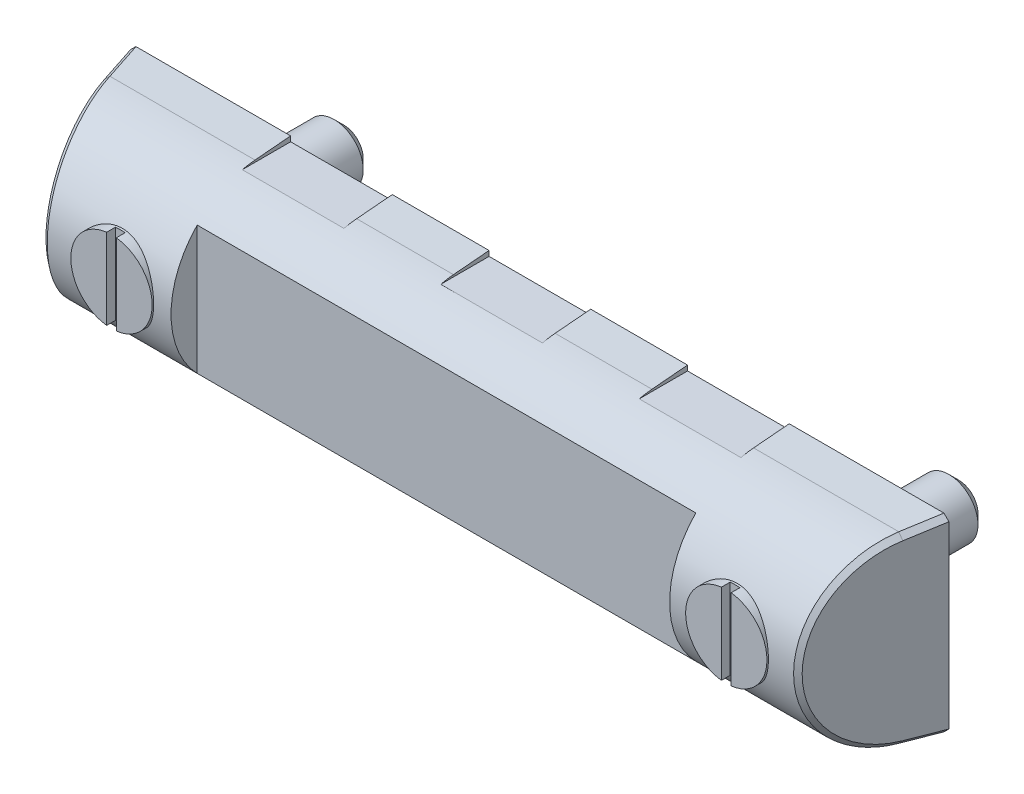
ISO-10303-21;
HEADER;
FILE_DESCRIPTION(('STEP AP214'),'2;1');
FILE_NAME('part.step','',(''),(''),'','','');
FILE_SCHEMA(('AUTOMOTIVE_DESIGN { 1 0 10303 214 1 1 1 1 }'));
ENDSEC;
DATA;
#1=APPLICATION_CONTEXT('core data for automotive mechanical design processes');
#2=APPLICATION_PROTOCOL_DEFINITION('international standard','automotive_design',2000,#1);
#3=PRODUCT_CONTEXT('',#1,'mechanical');
#4=PRODUCT('Part','Part','',(#3));
#5=PRODUCT_RELATED_PRODUCT_CATEGORY('part','',(#4));
#6=PRODUCT_DEFINITION_FORMATION('','',#4);
#7=PRODUCT_DEFINITION_CONTEXT('part definition',#1,'design');
#8=PRODUCT_DEFINITION('design','',#6,#7);
#9=PRODUCT_DEFINITION_SHAPE('','',#8);
#10=(LENGTH_UNIT() NAMED_UNIT(*) SI_UNIT(.MILLI.,.METRE.));
#11=(NAMED_UNIT(*) PLANE_ANGLE_UNIT() SI_UNIT($,.RADIAN.));
#12=(NAMED_UNIT(*) SI_UNIT($,.STERADIAN.) SOLID_ANGLE_UNIT());
#13=UNCERTAINTY_MEASURE_WITH_UNIT(LENGTH_MEASURE(1.E-05),#10,'distance_accuracy_value','');
#14=(GEOMETRIC_REPRESENTATION_CONTEXT(3) GLOBAL_UNCERTAINTY_ASSIGNED_CONTEXT((#13)) GLOBAL_UNIT_ASSIGNED_CONTEXT((#10,
#11,#12)) REPRESENTATION_CONTEXT('',''));
#15=CARTESIAN_POINT('',(0.,0.,0.));
#16=DIRECTION('',(0.,0.,1.));
#17=DIRECTION('',(1.,0.,0.));
#18=AXIS2_PLACEMENT_3D('',#15,#16,#17);
#19=CARTESIAN_POINT('',(0.,0.,-23.758787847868));
#20=DIRECTION('',(0.,0.,1.));
#21=DIRECTION('',(0.,-1.,0.));
#22=AXIS2_PLACEMENT_3D('',#19,#20,#21);
#23=CYLINDRICAL_SURFACE('',#22,8.4);
#24=CARTESIAN_POINT('',(0.,-8.4,22.7423003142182));
#25=CARTESIAN_POINT('',(-0.222649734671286,-8.39999823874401,22.7423022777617));
#26=CARTESIAN_POINT('',(-0.445361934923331,-8.39113506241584,22.7466786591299));
#27=CARTESIAN_POINT('',(-0.889140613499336,-8.35577817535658,22.764036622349));
#28=CARTESIAN_POINT('',(-1.11020602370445,-8.32927388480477,22.7770233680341));
#29=CARTESIAN_POINT('',(-1.54936097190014,-8.25887560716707,22.8111806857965));
#30=CARTESIAN_POINT('',(-1.76744373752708,-8.21494723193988,22.832367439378));
#31=CARTESIAN_POINT('',(-2.19871875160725,-8.11017313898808,22.8822132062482));
#32=CARTESIAN_POINT('',(-2.41190888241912,-8.04932024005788,22.910875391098));
#33=CARTESIAN_POINT('',(-2.83089998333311,-7.91166207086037,22.9745859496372));
#34=CARTESIAN_POINT('',(-3.0367319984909,-7.83493629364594,23.0096023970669));
#35=CARTESIAN_POINT('',(-3.44098987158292,-7.66600301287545,23.0850784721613));
#36=CARTESIAN_POINT('',(-3.63941285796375,-7.57378958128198,23.1255401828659));
#37=CARTESIAN_POINT('',(-4.02762310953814,-7.37467386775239,23.2107366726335));
#38=CARTESIAN_POINT('',(-4.2174154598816,-7.26778038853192,23.2554688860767));
#39=CARTESIAN_POINT('',(-4.58765013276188,-7.03993850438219,23.3480704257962));
#40=CARTESIAN_POINT('',(-4.76808900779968,-6.91898496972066,23.3959408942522));
#41=CARTESIAN_POINT('',(-5.12988780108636,-6.6556327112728,23.4967320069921));
#42=CARTESIAN_POINT('',(-5.31057595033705,-6.51235919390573,23.5497801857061));
#43=CARTESIAN_POINT('',(-5.65944456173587,-6.21158083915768,23.6566626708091));
#44=CARTESIAN_POINT('',(-5.8276245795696,-6.05407549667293,23.7104970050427));
#45=CARTESIAN_POINT('',(-6.1506714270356,-5.72558599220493,23.8176025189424));
#46=CARTESIAN_POINT('',(-6.30553049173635,-5.55459407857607,23.8708733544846));
#47=CARTESIAN_POINT('',(-6.60087336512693,-5.20016019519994,23.9754606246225));
#48=CARTESIAN_POINT('',(-6.74136208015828,-5.01672251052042,24.0267777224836));
#49=CARTESIAN_POINT('',(-7.01382775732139,-4.62873693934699,24.1287008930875));
#50=CARTESIAN_POINT('',(-7.14501720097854,-4.42359086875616,24.1791403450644));
#51=CARTESIAN_POINT('',(-7.38947266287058,-4.00188267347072,24.2750280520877));
#52=CARTESIAN_POINT('',(-7.50274612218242,-3.78532533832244,24.3204783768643));
#53=CARTESIAN_POINT('',(-7.71036667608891,-3.34217064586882,24.4050999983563));
#54=CARTESIAN_POINT('',(-7.80471673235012,-3.11557486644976,24.4442722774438));
#55=CARTESIAN_POINT('',(-7.97351061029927,-2.65396081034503,24.51518003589));
#56=CARTESIAN_POINT('',(-8.04795602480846,-2.41894320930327,24.5469161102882));
#57=CARTESIAN_POINT('',(-8.17237489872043,-1.95610729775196,24.6003900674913));
#58=CARTESIAN_POINT('',(-8.22351263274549,-1.72865614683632,24.6225992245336));
#59=CARTESIAN_POINT('',(-8.30676596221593,-1.26965830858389,24.6589280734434));
#60=CARTESIAN_POINT('',(-8.33888222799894,-1.03811176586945,24.6730480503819));
#61=CARTESIAN_POINT('',(-8.38369877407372,-0.572876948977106,24.6927881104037));
#62=CARTESIAN_POINT('',(-8.39640663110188,-0.339189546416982,24.6984115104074));
#63=CARTESIAN_POINT('',(-8.40227185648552,0.128473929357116,24.7010042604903));
#64=CARTESIAN_POINT('',(-8.39543009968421,0.362449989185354,24.6979739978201));
#65=CARTESIAN_POINT('',(-8.36342494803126,0.812723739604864,24.6838535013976));
#66=CARTESIAN_POINT('',(-8.33955148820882,1.02913242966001,24.6733308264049));
#67=CARTESIAN_POINT('',(-8.27516737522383,1.4590631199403,24.6451196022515));
#68=CARTESIAN_POINT('',(-8.2346509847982,1.67258409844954,24.627428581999));
#69=CARTESIAN_POINT('',(-8.13740627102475,2.09513951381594,24.5853240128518));
#70=CARTESIAN_POINT('',(-8.08068348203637,2.30417545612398,24.5609127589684));
#71=CARTESIAN_POINT('',(-7.95153228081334,2.71658720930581,24.5059419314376));
#72=CARTESIAN_POINT('',(-7.87909788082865,2.91996082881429,24.4753800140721));
#73=CARTESIAN_POINT('',(-7.71797571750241,3.32273934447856,24.4083324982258));
#74=CARTESIAN_POINT('',(-7.62906252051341,3.52204042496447,24.3717656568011));
#75=CARTESIAN_POINT('',(-7.4364066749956,3.91244933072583,24.2938802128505));
#76=CARTESIAN_POINT('',(-7.33265900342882,4.1035543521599,24.2525600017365));
#77=CARTESIAN_POINT('',(-7.11109244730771,4.47654145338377,24.1661103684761));
#78=CARTESIAN_POINT('',(-6.99327208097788,4.65842255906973,24.1209805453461));
#79=CARTESIAN_POINT('',(-6.74431838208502,5.01207940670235,24.0279159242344));
#80=CARTESIAN_POINT('',(-6.61318419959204,5.1838545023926,23.9799809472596));
#81=CARTESIAN_POINT('',(-6.32760929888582,5.52950852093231,23.8785439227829));
#82=CARTESIAN_POINT('',(-6.17214816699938,5.70250363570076,23.8248994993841));
#83=CARTESIAN_POINT('',(-5.84759213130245,6.03486588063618,23.7169620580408));
#84=CARTESIAN_POINT('',(-5.6785009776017,6.19423673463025,23.6626692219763));
#85=CARTESIAN_POINT('',(-5.32741671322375,6.49866584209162,23.5547877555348));
#86=CARTESIAN_POINT('',(-5.14541301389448,6.64371211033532,23.5011997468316));
#87=CARTESIAN_POINT('',(-4.76965084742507,6.91842299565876,23.396243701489));
#88=CARTESIAN_POINT('',(-4.57589687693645,7.04809344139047,23.3448748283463));
#89=CARTESIAN_POINT('',(-4.1693178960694,7.29628913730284,23.2437414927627));
#90=CARTESIAN_POINT('',(-3.9560352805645,7.41412963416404,23.1941317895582));
#91=CARTESIAN_POINT('',(-3.51912637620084,7.63120047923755,23.1005388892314));
#92=CARTESIAN_POINT('',(-3.29550471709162,7.730439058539,23.0565532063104));
#93=CARTESIAN_POINT('',(-2.8394078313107,7.9093450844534,22.9757604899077));
#94=CARTESIAN_POINT('',(-2.60693645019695,7.98902092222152,22.9389503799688));
#95=CARTESIAN_POINT('',(-2.13479640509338,8.1279257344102,22.8738965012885));
#96=CARTESIAN_POINT('',(-1.89512848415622,8.18715681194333,22.8456518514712));
#97=CARTESIAN_POINT('',(-1.42762029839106,8.28098336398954,22.8005212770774));
#98=CARTESIAN_POINT('',(-1.2001317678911,8.31701706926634,22.782976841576));
#99=CARTESIAN_POINT('',(-0.742449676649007,8.37029479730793,22.7569356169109));
#100=CARTESIAN_POINT('',(-0.512256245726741,8.38753971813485,22.748438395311));
#101=CARTESIAN_POINT('',(-0.0511612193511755,8.40301002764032,22.7408185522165));
#102=CARTESIAN_POINT('',(0.179740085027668,8.40124239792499,22.7416924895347));
#103=CARTESIAN_POINT('',(0.640383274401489,8.37872773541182,22.752773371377));
#104=CARTESIAN_POINT('',(0.870125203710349,8.357981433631,22.762979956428));
#105=CARTESIAN_POINT('',(1.309112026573,8.3000866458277,22.7912112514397));
#106=CARTESIAN_POINT('',(1.51858243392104,8.26431166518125,22.8085794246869));
#107=CARTESIAN_POINT('',(1.93360322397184,8.17717288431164,22.8503987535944));
#108=CARTESIAN_POINT('',(2.13915224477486,8.12580376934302,22.8748523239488));
#109=CARTESIAN_POINT('',(2.54496401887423,8.00798235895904,22.93010291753));
#110=CARTESIAN_POINT('',(2.74522775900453,7.9415329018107,22.9608987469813));
#111=CARTESIAN_POINT('',(3.13943023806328,7.79412089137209,23.0279607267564));
#112=CARTESIAN_POINT('',(3.33336645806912,7.71315263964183,23.0642290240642));
#113=CARTESIAN_POINT('',(3.92093834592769,7.44160950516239,23.1832126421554));
#114=CARTESIAN_POINT('',(4.30246875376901,7.22757063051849,23.2735580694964));
#115=CARTESIAN_POINT('',(5.02610757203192,6.74446085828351,23.4645564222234));
#116=CARTESIAN_POINT('',(5.36819743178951,6.47536422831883,23.5652141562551));
#117=CARTESIAN_POINT('',(5.86194984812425,6.02112361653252,23.721515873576));
#118=CARTESIAN_POINT('',(6.02973108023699,5.85309649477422,23.7769164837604));
#119=CARTESIAN_POINT('',(6.35063550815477,5.50324636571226,23.8864738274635));
#120=CARTESIAN_POINT('',(6.50376347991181,5.32142788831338,23.9406309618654));
#121=CARTESIAN_POINT('',(6.79447289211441,4.94487180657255,24.0462941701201));
#122=CARTESIAN_POINT('',(6.93204549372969,4.75012695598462,24.097798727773));
#123=CARTESIAN_POINT('',(7.19049496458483,4.34898569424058,24.1967286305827));
#124=CARTESIAN_POINT('',(7.31137906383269,4.14259438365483,24.2441557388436));
#125=CARTESIAN_POINT('',(7.53644196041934,3.71757194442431,24.3340339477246));
#126=CARTESIAN_POINT('',(7.6404740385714,3.49885356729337,24.3764405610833));
#127=CARTESIAN_POINT('',(7.82960946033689,3.05221630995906,24.4546091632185));
#128=CARTESIAN_POINT('',(7.91471248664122,2.82429727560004,24.490371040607));
#129=CARTESIAN_POINT('',(8.06502317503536,2.36107139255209,24.5541763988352));
#130=CARTESIAN_POINT('',(8.1302418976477,2.12576873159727,24.5822241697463));
#131=CARTESIAN_POINT('',(8.24006384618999,1.64955772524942,24.629770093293));
#132=CARTESIAN_POINT('',(8.28466886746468,1.40864986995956,24.6492689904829));
#133=CARTESIAN_POINT('',(8.3500783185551,0.941996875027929,24.677961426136));
#134=CARTESIAN_POINT('',(8.37245042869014,0.71651189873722,24.6878326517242));
#135=CARTESIAN_POINT('',(8.39889631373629,0.264267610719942,24.6995082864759));
#136=CARTESIAN_POINT('',(8.40297107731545,0.0375083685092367,24.7013131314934));
#137=CARTESIAN_POINT('',(8.39277675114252,-0.415469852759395,24.6968071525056));
#138=CARTESIAN_POINT('',(8.37851117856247,-0.641688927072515,24.690497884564));
#139=CARTESIAN_POINT('',(8.33180766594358,-1.09187506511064,24.6699388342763));
#140=CARTESIAN_POINT('',(8.2993699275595,-1.31584215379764,24.6556891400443));
#141=CARTESIAN_POINT('',(8.21850346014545,-1.7500926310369,24.6204265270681));
#142=CARTESIAN_POINT('',(8.17083844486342,-1.96054535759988,24.5997376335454));
#143=CARTESIAN_POINT('',(8.05967466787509,-2.37655552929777,24.5519451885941));
#144=CARTESIAN_POINT('',(7.99617039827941,-2.58211124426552,24.5248394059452));
#145=CARTESIAN_POINT('',(7.85392705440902,-2.98694709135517,24.4648611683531));
#146=CARTESIAN_POINT('',(7.77519180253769,-3.18622878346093,24.4319901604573));
#147=CARTESIAN_POINT('',(7.60309212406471,-3.57752634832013,24.3612126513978));
#148=CARTESIAN_POINT('',(7.50972211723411,-3.76953941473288,24.323304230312));
#149=CARTESIAN_POINT('',(7.30449959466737,-4.15377610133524,24.2414794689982));
#150=CARTESIAN_POINT('',(7.19199984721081,-4.34561251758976,24.1973683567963));
#151=CARTESIAN_POINT('',(6.95255749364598,-4.71923704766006,24.1055922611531));
#152=CARTESIAN_POINT('',(6.82560992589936,-4.90102167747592,24.0579260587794));
#153=CARTESIAN_POINT('',(6.55808516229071,-5.25361794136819,23.9601472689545));
#154=CARTESIAN_POINT('',(6.41750550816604,-5.42442758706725,23.9100342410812));
#155=CARTESIAN_POINT('',(6.12352949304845,-5.75423248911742,23.808522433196));
#156=CARTESIAN_POINT('',(5.97013245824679,-5.9132271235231,23.7571235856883));
#157=CARTESIAN_POINT('',(5.63884506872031,-6.23057531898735,23.6502120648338));
#158=CARTESIAN_POINT('',(5.45997742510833,-6.38790790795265,23.5946917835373));
#159=CARTESIAN_POINT('',(5.08932165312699,-6.68696451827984,23.4851023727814));
#160=CARTESIAN_POINT('',(4.8975376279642,-6.82869345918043,23.4310327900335));
#161=CARTESIAN_POINT('',(4.50182611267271,-7.09581591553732,23.3258341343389));
#162=CARTESIAN_POINT('',(4.29788594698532,-7.2211919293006,23.2747082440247));
#163=CARTESIAN_POINT('',(3.87928666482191,-7.45442894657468,23.1770556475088));
#164=CARTESIAN_POINT('',(3.66463244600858,-7.5622978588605,23.1305268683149));
#165=CARTESIAN_POINT('',(3.22504308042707,-7.75998564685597,23.0434235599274));
#166=CARTESIAN_POINT('',(3.00007426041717,-7.84973934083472,23.002870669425));
#167=CARTESIAN_POINT('',(2.54220431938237,-8.00974199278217,22.9293874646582));
#168=CARTESIAN_POINT('',(2.30930723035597,-8.08000070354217,22.8964533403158));
#169=CARTESIAN_POINT('',(1.83789521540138,-8.20007031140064,22.8395232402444));
#170=CARTESIAN_POINT('',(1.59939681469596,-8.2499349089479,22.8155038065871));
#171=CARTESIAN_POINT('',(1.11832255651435,-8.32878643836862,22.7772731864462));
#172=CARTESIAN_POINT('',(0.875749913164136,-8.35778910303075,22.7630546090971));
#173=CARTESIAN_POINT('',(0.527130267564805,-8.38410817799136,22.7501256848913));
#174=CARTESIAN_POINT('',(0.421820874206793,-8.3900652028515,22.7471940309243));
#175=CARTESIAN_POINT('',(0.211012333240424,-8.39801158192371,22.7432808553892));
#176=CARTESIAN_POINT('',(0.105513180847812,-8.40000083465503,22.7422993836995));
#177=CARTESIAN_POINT('',(0.,-8.4,22.7423003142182));
#178=B_SPLINE_CURVE_WITH_KNOTS('',3,(#24,#25,#26,#27,#28,#29,#30,#31,#32,#33,#34,#35,#36,#37,
#38,#39,#40,#41,#42,#43,#44,#45,#46,#47,#48,#49,#50,#51,#52,#53,#54,#55,#56,#57,#58,#59,#60,#61,
#62,#63,#64,#65,#66,#67,#68,#69,#70,#71,#72,#73,#74,#75,#76,#77,#78,#79,#80,#81,#82,#83,#84,#85,
#86,#87,#88,#89,#90,#91,#92,#93,#94,#95,#96,#97,#98,#99,#100,#101,#102,#103,#104,#105,#106,#107,
#108,#109,#110,#111,#112,#113,#114,#115,#116,#117,#118,#119,#120,#121,#122,#123,#124,#125,#126,
#127,#128,#129,#130,#131,#132,#133,#134,#135,#136,#137,#138,#139,#140,#141,#142,#143,#144,#145,
#146,#147,#148,#149,#150,#151,#152,#153,#154,#155,#156,#157,#158,#159,#160,#161,#162,#163,#164,
#165,#166,#167,#168,#169,#170,#171,#172,#173,#174,#175,#176,#177),.UNSPECIFIED.,.T.,.F.,(4,2,2,
2,2,2,2,2,2,2,2,2,2,2,2,2,2,2,2,2,2,2,2,2,2,2,2,2,2,2,2,2,2,2,2,2,2,2,2,2,2,2,2,2,2,2,2,2,2,2,2,
2,2,2,2,2,2,2,2,2,2,2,2,2,2,2,2,2,2,2,2,2,2,2,2,2,4),(0.,0.667839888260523,1.33608065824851,
2.00564688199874,2.67549764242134,3.34207158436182,4.00890124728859,4.6753327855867,
5.34200823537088,6.0510987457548,6.76021443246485,7.46974070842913,8.17902392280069,
8.92410698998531,9.66887978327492,10.4135359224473,11.1581324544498,11.8597613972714,
12.5613656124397,13.2626958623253,13.963994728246,14.61715268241,15.2705359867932,
15.923696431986,16.577106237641,17.2402212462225,17.9035613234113,18.5669713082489,
19.2304236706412,19.945701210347,20.6607826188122,21.3764573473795,22.09185990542,
22.8369158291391,23.5816412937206,24.3260467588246,25.0703756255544,25.7624204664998,
26.4544322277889,27.1461898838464,27.8379208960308,28.4768289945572,29.1159550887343,
29.7549609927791,30.3942182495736,31.7284332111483,33.0632731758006,33.7940460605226,
34.5245799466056,35.2555268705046,35.9861561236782,36.7228393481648,37.4595349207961,
38.1958199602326,38.9320408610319,39.6115945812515,40.2911115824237,40.9704982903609,
41.6498774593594,42.2994609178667,42.9492705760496,43.5989173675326,44.2488124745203,
44.9282502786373,45.6079221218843,46.2877167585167,46.967547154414,47.7005016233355,
48.4332243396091,49.1667249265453,49.8998932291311,50.6356543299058,51.3710466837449,
52.1044899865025,52.8373795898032,53.1538592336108,53.4703469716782),.UNSPECIFIED.);
#179=CARTESIAN_POINT('',(0.,-8.4,22.7423003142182));
#180=VERTEX_POINT('',#179);
#181=EDGE_CURVE('E323',#180,#180,#178,.T.);
#182=ORIENTED_EDGE('',*,*,#181,.F.);
#183=EDGE_LOOP('',(#182));
#184=FACE_BOUND('',#183,.T.);
#185=DIRECTION('',(0.,0.,1.));
#186=VECTOR('',#185,1.);
#187=CARTESIAN_POINT('',(1.,8.34026378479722,-23.758787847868));
#188=LINE('',#187,#186);
#189=CARTESIAN_POINT('',(1.,8.34026378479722,25.));
#190=VERTEX_POINT('',#189);
#191=CARTESIAN_POINT('',(1.,8.34026378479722,23.2));
#192=VERTEX_POINT('',#191);
#193=EDGE_CURVE('E312',#190,#192,#188,.F.);
#194=ORIENTED_EDGE('',*,*,#193,.F.);
#195=CARTESIAN_POINT('',(0.,0.,25.));
#196=DIRECTION('',(0.,0.,-1.));
#197=DIRECTION('',(0.,1.,0.));
#198=AXIS2_PLACEMENT_3D('',#195,#196,#197);
#199=CIRCLE('',#198,8.4);
#200=CARTESIAN_POINT('',(1.,-8.34026378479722,25.));
#201=VERTEX_POINT('',#200);
#202=EDGE_CURVE('E320',#190,#201,#199,.T.);
#203=ORIENTED_EDGE('',*,*,#202,.T.);
#204=DIRECTION('',(0.,0.,1.));
#205=VECTOR('',#204,1.);
#206=CARTESIAN_POINT('',(1.,-8.34026378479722,-23.758787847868));
#207=LINE('',#206,#205);
#208=CARTESIAN_POINT('',(1.,-8.34026378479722,23.2));
#209=VERTEX_POINT('',#208);
#210=EDGE_CURVE('E314',#209,#201,#207,.T.);
#211=ORIENTED_EDGE('',*,*,#210,.F.);
#212=CARTESIAN_POINT('',(0.,0.,23.2));
#213=DIRECTION('',(0.,0.,-1.));
#214=DIRECTION('',(0.,1.,0.));
#215=AXIS2_PLACEMENT_3D('',#212,#213,#214);
#216=CIRCLE('',#215,8.4);
#217=CARTESIAN_POINT('',(-1.,-8.34026378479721,23.2));
#218=VERTEX_POINT('',#217);
#219=EDGE_CURVE('E299',#209,#218,#216,.T.);
#220=ORIENTED_EDGE('',*,*,#219,.T.);
#221=DIRECTION('',(0.,0.,1.));
#222=VECTOR('',#221,1.);
#223=CARTESIAN_POINT('',(-1.,-8.34026378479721,-23.758787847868));
#224=LINE('',#223,#222);
#225=CARTESIAN_POINT('',(-1.,-8.34026378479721,25.));
#226=VERTEX_POINT('',#225);
#227=EDGE_CURVE('E306',#226,#218,#224,.F.);
#228=ORIENTED_EDGE('',*,*,#227,.F.);
#229=CARTESIAN_POINT('',(-1.,8.34026378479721,25.));
#230=VERTEX_POINT('',#229);
#231=EDGE_CURVE('E311',#226,#230,#199,.T.);
#232=ORIENTED_EDGE('',*,*,#231,.T.);
#233=DIRECTION('',(0.,0.,1.));
#234=VECTOR('',#233,1.);
#235=CARTESIAN_POINT('',(-1.,8.34026378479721,-23.758787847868));
#236=LINE('',#235,#234);
#237=CARTESIAN_POINT('',(-1.,8.34026378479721,23.2));
#238=VERTEX_POINT('',#237);
#239=EDGE_CURVE('E303',#238,#230,#236,.T.);
#240=ORIENTED_EDGE('',*,*,#239,.F.);
#241=EDGE_CURVE('E288',#238,#192,#216,.T.);
#242=ORIENTED_EDGE('',*,*,#241,.T.);
#243=EDGE_LOOP('',(#194,#203,#211,#220,#228,#232,#240,#242));
#244=FACE_BOUND('',#243,.T.);
#245=ADVANCED_FACE('F14',(#184,#244),#23,.T.);
#246=CARTESIAN_POINT('',(0.,0.,25.));
#247=DIRECTION('',(0.,0.,-1.));
#248=DIRECTION('',(0.,1.,0.));
#249=AXIS2_PLACEMENT_3D('',#246,#247,#248);
#250=PLANE('',#249);
#251=DIRECTION('',(0.,1.,0.));
#252=VECTOR('',#251,1.);
#253=CARTESIAN_POINT('',(1.,0.,25.));
#254=LINE('',#253,#252);
#255=EDGE_CURVE('E392',#201,#190,#254,.T.);
#256=ORIENTED_EDGE('',*,*,#255,.F.);
#257=ORIENTED_EDGE('',*,*,#202,.F.);
#258=EDGE_LOOP('',(#256,#257));
#259=FACE_BOUND('',#258,.T.);
#260=ADVANCED_FACE('F341',(#259),#250,.F.);
#261=DIRECTION('',(0.,-1.,0.));
#262=VECTOR('',#261,1.);
#263=CARTESIAN_POINT('',(-1.,0.,25.));
#264=LINE('',#263,#262);
#265=EDGE_CURVE('E390',#230,#226,#264,.T.);
#266=ORIENTED_EDGE('',*,*,#265,.F.);
#267=ORIENTED_EDGE('',*,*,#231,.F.);
#268=EDGE_LOOP('',(#266,#267));
#269=FACE_BOUND('',#268,.T.);
#270=ADVANCED_FACE('F768',(#269),#250,.F.);
#271=CARTESIAN_POINT('',(148.,0.,5.69999999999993));
#272=DIRECTION('',(-1.,0.,0.));
#273=DIRECTION('',(0.,0.,-1.));
#274=AXIS2_PLACEMENT_3D('',#271,#272,#273);
#275=CYLINDRICAL_SURFACE('',#274,19.);
#276=CARTESIAN_POINT('',(127.,-8.4,22.7423003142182));
#277=CARTESIAN_POINT('',(126.777350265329,-8.39999823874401,22.7423022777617));
#278=CARTESIAN_POINT('',(126.554638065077,-8.39113506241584,22.7466786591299));
#279=CARTESIAN_POINT('',(126.110859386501,-8.35577817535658,22.764036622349));
#280=CARTESIAN_POINT('',(125.889793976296,-8.32927388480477,22.7770233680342));
#281=CARTESIAN_POINT('',(125.4506390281,-8.25887560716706,22.8111806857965));
#282=CARTESIAN_POINT('',(125.232556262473,-8.21494723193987,22.832367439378));
#283=CARTESIAN_POINT('',(124.801281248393,-8.11017313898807,22.8822132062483));
#284=CARTESIAN_POINT('',(124.588091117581,-8.04932024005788,22.910875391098));
#285=CARTESIAN_POINT('',(124.169100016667,-7.91166207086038,22.9745859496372));
#286=CARTESIAN_POINT('',(123.963268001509,-7.83493629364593,23.0096023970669));
#287=CARTESIAN_POINT('',(123.559010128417,-7.66600301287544,23.0850784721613));
#288=CARTESIAN_POINT('',(123.360587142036,-7.57378958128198,23.1255401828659));
#289=CARTESIAN_POINT('',(122.972376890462,-7.37467386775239,23.2107366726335));
#290=CARTESIAN_POINT('',(122.782584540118,-7.26778038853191,23.2554688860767));
#291=CARTESIAN_POINT('',(122.412349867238,-7.03993850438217,23.3480704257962));
#292=CARTESIAN_POINT('',(122.2319109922,-6.91898496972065,23.3959408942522));
#293=CARTESIAN_POINT('',(121.870112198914,-6.65563271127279,23.4967320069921));
#294=CARTESIAN_POINT('',(121.689424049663,-6.51235919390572,23.5497801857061));
#295=CARTESIAN_POINT('',(121.340555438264,-6.21158083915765,23.6566626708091));
#296=CARTESIAN_POINT('',(121.17237542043,-6.0540754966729,23.7104970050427));
#297=CARTESIAN_POINT('',(120.849328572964,-5.72558599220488,23.8176025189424));
#298=CARTESIAN_POINT('',(120.694469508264,-5.55459407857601,23.8708733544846));
#299=CARTESIAN_POINT('',(120.399126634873,-5.20016019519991,23.9754606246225));
#300=CARTESIAN_POINT('',(120.258637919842,-5.01672251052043,24.0267777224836));
#301=CARTESIAN_POINT('',(119.986172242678,-4.62873693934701,24.1287008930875));
#302=CARTESIAN_POINT('',(119.854982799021,-4.42359086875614,24.1791403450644));
#303=CARTESIAN_POINT('',(119.610527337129,-4.00188267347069,24.2750280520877));
#304=CARTESIAN_POINT('',(119.497253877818,-3.78532533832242,24.3204783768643));
#305=CARTESIAN_POINT('',(119.289633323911,-3.34217064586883,24.4050999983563));
#306=CARTESIAN_POINT('',(119.19528326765,-3.11557486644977,24.4442722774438));
#307=CARTESIAN_POINT('',(119.026489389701,-2.65396081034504,24.51518003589));
#308=CARTESIAN_POINT('',(118.952043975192,-2.41894320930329,24.5469161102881));
#309=CARTESIAN_POINT('',(118.82762510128,-1.95610729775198,24.6003900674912));
#310=CARTESIAN_POINT('',(118.776487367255,-1.72865614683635,24.6225992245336));
#311=CARTESIAN_POINT('',(118.693234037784,-1.26965830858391,24.6589280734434));
#312=CARTESIAN_POINT('',(118.661117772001,-1.03811176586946,24.6730480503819));
#313=CARTESIAN_POINT('',(118.616301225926,-0.572876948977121,24.6927881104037));
#314=CARTESIAN_POINT('',(118.603593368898,-0.339189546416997,24.6984115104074));
#315=CARTESIAN_POINT('',(118.597728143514,0.128473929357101,24.7010042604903));
#316=CARTESIAN_POINT('',(118.604569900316,0.362449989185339,24.6979739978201));
#317=CARTESIAN_POINT('',(118.636575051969,0.812723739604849,24.6838535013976));
#318=CARTESIAN_POINT('',(118.660448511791,1.02913242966,24.6733308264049));
#319=CARTESIAN_POINT('',(118.724832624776,1.45906311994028,24.6451196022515));
#320=CARTESIAN_POINT('',(118.765349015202,1.67258409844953,24.627428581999));
#321=CARTESIAN_POINT('',(118.862593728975,2.09513951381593,24.5853240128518));
#322=CARTESIAN_POINT('',(118.919316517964,2.30417545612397,24.5609127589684));
#323=CARTESIAN_POINT('',(119.048467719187,2.7165872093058,24.5059419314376));
#324=CARTESIAN_POINT('',(119.120902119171,2.91996082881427,24.4753800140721));
#325=CARTESIAN_POINT('',(119.282024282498,3.32273934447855,24.4083324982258));
#326=CARTESIAN_POINT('',(119.370937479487,3.52204042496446,24.3717656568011));
#327=CARTESIAN_POINT('',(119.563593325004,3.91244933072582,24.2938802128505));
#328=CARTESIAN_POINT('',(119.667340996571,4.10355435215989,24.2525600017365));
#329=CARTESIAN_POINT('',(119.888907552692,4.47654145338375,24.1661103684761));
#330=CARTESIAN_POINT('',(120.006727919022,4.65842255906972,24.1209805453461));
#331=CARTESIAN_POINT('',(120.255681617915,5.01207940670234,24.0279159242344));
#332=CARTESIAN_POINT('',(120.386815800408,5.18385450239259,23.9799809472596));
#333=CARTESIAN_POINT('',(120.672390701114,5.5295085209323,23.8785439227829));
#334=CARTESIAN_POINT('',(120.827851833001,5.70250363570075,23.8248994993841));
#335=CARTESIAN_POINT('',(121.152407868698,6.03486588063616,23.7169620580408));
#336=CARTESIAN_POINT('',(121.321499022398,6.19423673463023,23.6626692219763));
#337=CARTESIAN_POINT('',(121.672583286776,6.49866584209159,23.5547877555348));
#338=CARTESIAN_POINT('',(121.854586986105,6.64371211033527,23.5011997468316));
#339=CARTESIAN_POINT('',(122.230349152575,6.91842299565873,23.396243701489));
#340=CARTESIAN_POINT('',(122.424103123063,7.04809344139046,23.3448748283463));
#341=CARTESIAN_POINT('',(122.83068210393,7.29628913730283,23.2437414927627));
#342=CARTESIAN_POINT('',(123.043964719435,7.41412963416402,23.1941317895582));
#343=CARTESIAN_POINT('',(123.480873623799,7.63120047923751,23.1005388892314));
#344=CARTESIAN_POINT('',(123.704495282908,7.73043905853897,23.0565532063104));
#345=CARTESIAN_POINT('',(124.160592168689,7.90934508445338,22.9757604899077));
#346=CARTESIAN_POINT('',(124.393063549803,7.98902092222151,22.9389503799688));
#347=CARTESIAN_POINT('',(124.865203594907,8.12792573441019,22.8738965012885));
#348=CARTESIAN_POINT('',(125.104871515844,8.18715681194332,22.8456518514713));
#349=CARTESIAN_POINT('',(125.572379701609,8.28098336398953,22.8005212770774));
#350=CARTESIAN_POINT('',(125.799868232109,8.31701706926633,22.782976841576));
#351=CARTESIAN_POINT('',(126.257550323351,8.37029479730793,22.7569356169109));
#352=CARTESIAN_POINT('',(126.487743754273,8.38753971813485,22.748438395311));
#353=CARTESIAN_POINT('',(126.948838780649,8.40301002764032,22.7408185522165));
#354=CARTESIAN_POINT('',(127.179740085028,8.401242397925,22.7416924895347));
#355=CARTESIAN_POINT('',(127.640383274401,8.37872773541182,22.752773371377));
#356=CARTESIAN_POINT('',(127.87012520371,8.35798143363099,22.762979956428));
#357=CARTESIAN_POINT('',(128.309112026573,8.3000866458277,22.7912112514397));
#358=CARTESIAN_POINT('',(128.518582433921,8.26431166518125,22.8085794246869));
#359=CARTESIAN_POINT('',(128.933603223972,8.17717288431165,22.8503987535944));
#360=CARTESIAN_POINT('',(129.139152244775,8.12580376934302,22.8748523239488));
#361=CARTESIAN_POINT('',(129.544964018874,8.00798235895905,22.93010291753));
#362=CARTESIAN_POINT('',(129.745227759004,7.94153290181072,22.9608987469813));
#363=CARTESIAN_POINT('',(130.139430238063,7.79412089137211,23.0279607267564));
#364=CARTESIAN_POINT('',(130.333366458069,7.71315263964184,23.0642290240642));
#365=CARTESIAN_POINT('',(130.920938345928,7.44160950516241,23.1832126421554));
#366=CARTESIAN_POINT('',(131.302468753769,7.22757063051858,23.2735580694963));
#367=CARTESIAN_POINT('',(132.026107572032,6.74446085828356,23.4645564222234));
#368=CARTESIAN_POINT('',(132.368197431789,6.4753642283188,23.5652141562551));
#369=CARTESIAN_POINT('',(132.861949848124,6.02112361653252,23.721515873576));
#370=CARTESIAN_POINT('',(133.029731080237,5.85309649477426,23.7769164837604));
#371=CARTESIAN_POINT('',(133.350635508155,5.5032463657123,23.8864738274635));
#372=CARTESIAN_POINT('',(133.503763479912,5.3214278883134,23.9406309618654));
#373=CARTESIAN_POINT('',(133.794472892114,4.94487180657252,24.0462941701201));
#374=CARTESIAN_POINT('',(133.93204549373,4.75012695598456,24.0977987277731));
#375=CARTESIAN_POINT('',(134.190494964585,4.34898569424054,24.1967286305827));
#376=CARTESIAN_POINT('',(134.311379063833,4.14259438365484,24.2441557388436));
#377=CARTESIAN_POINT('',(134.53644196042,3.71757194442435,24.3340339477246));
#378=CARTESIAN_POINT('',(134.640474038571,3.49885356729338,24.3764405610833));
#379=CARTESIAN_POINT('',(134.829609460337,3.05221630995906,24.4546091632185));
#380=CARTESIAN_POINT('',(134.914712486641,2.82429727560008,24.490371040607));
#381=CARTESIAN_POINT('',(135.065023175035,2.36107139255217,24.5541763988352));
#382=CARTESIAN_POINT('',(135.130241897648,2.12576873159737,24.5822241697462));
#383=CARTESIAN_POINT('',(135.24006384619,1.64955772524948,24.6297700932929));
#384=CARTESIAN_POINT('',(135.284668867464,1.40864986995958,24.6492689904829));
#385=CARTESIAN_POINT('',(135.350078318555,0.941996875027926,24.677961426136));
#386=CARTESIAN_POINT('',(135.37245042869,0.716511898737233,24.6878326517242));
#387=CARTESIAN_POINT('',(135.398896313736,0.264267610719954,24.6995082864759));
#388=CARTESIAN_POINT('',(135.402971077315,0.0375083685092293,24.7013131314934));
#389=CARTESIAN_POINT('',(135.392776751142,-0.415469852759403,24.6968071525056));
#390=CARTESIAN_POINT('',(135.378511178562,-0.641688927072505,24.690497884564));
#391=CARTESIAN_POINT('',(135.331807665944,-1.09187506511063,24.6699388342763));
#392=CARTESIAN_POINT('',(135.29936992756,-1.31584215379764,24.6556891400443));
#393=CARTESIAN_POINT('',(135.218503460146,-1.75009263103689,24.6204265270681));
#394=CARTESIAN_POINT('',(135.170838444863,-1.96054535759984,24.5997376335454));
#395=CARTESIAN_POINT('',(135.059674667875,-2.37655552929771,24.5519451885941));
#396=CARTESIAN_POINT('',(134.996170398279,-2.58211124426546,24.5248394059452));
#397=CARTESIAN_POINT('',(134.853927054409,-2.98694709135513,24.4648611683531));
#398=CARTESIAN_POINT('',(134.775191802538,-3.18622878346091,24.4319901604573));
#399=CARTESIAN_POINT('',(134.603092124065,-3.57752634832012,24.3612126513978));
#400=CARTESIAN_POINT('',(134.509722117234,-3.76953941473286,24.323304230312));
#401=CARTESIAN_POINT('',(134.304499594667,-4.15377610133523,24.2414794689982));
#402=CARTESIAN_POINT('',(134.191999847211,-4.34561251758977,24.1973683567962));
#403=CARTESIAN_POINT('',(133.952557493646,-4.71923704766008,24.1055922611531));
#404=CARTESIAN_POINT('',(133.825609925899,-4.90102167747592,24.0579260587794));
#405=CARTESIAN_POINT('',(133.558085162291,-5.25361794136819,23.9601472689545));
#406=CARTESIAN_POINT('',(133.417505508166,-5.42442758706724,23.9100342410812));
#407=CARTESIAN_POINT('',(133.123529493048,-5.75423248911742,23.808522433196));
#408=CARTESIAN_POINT('',(132.970132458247,-5.91322712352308,23.7571235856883));
#409=CARTESIAN_POINT('',(132.63884506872,-6.23057531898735,23.6502120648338));
#410=CARTESIAN_POINT('',(132.459977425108,-6.38790790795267,23.5946917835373));
#411=CARTESIAN_POINT('',(132.089321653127,-6.68696451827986,23.4851023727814));
#412=CARTESIAN_POINT('',(131.897537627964,-6.82869345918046,23.4310327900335));
#413=CARTESIAN_POINT('',(131.501826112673,-7.09581591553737,23.3258341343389));
#414=CARTESIAN_POINT('',(131.297885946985,-7.22119192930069,23.2747082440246));
#415=CARTESIAN_POINT('',(130.879286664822,-7.45442894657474,23.1770556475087));
#416=CARTESIAN_POINT('',(130.664632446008,-7.56229785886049,23.1305268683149));
#417=CARTESIAN_POINT('',(130.225043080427,-7.75998564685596,23.0434235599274));
#418=CARTESIAN_POINT('',(130.000074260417,-7.84973934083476,23.002870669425));
#419=CARTESIAN_POINT('',(129.542204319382,-8.00974199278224,22.9293874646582));
#420=CARTESIAN_POINT('',(129.309307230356,-8.08000070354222,22.8964533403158));
#421=CARTESIAN_POINT('',(128.837895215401,-8.20007031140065,22.8395232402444));
#422=CARTESIAN_POINT('',(128.599396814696,-8.24993490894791,22.8155038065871));
#423=CARTESIAN_POINT('',(128.118322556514,-8.32878643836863,22.7772731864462));
#424=CARTESIAN_POINT('',(127.875749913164,-8.35778910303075,22.7630546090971));
#425=CARTESIAN_POINT('',(127.527130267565,-8.38410817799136,22.7501256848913));
#426=CARTESIAN_POINT('',(127.421820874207,-8.3900652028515,22.7471940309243));
#427=CARTESIAN_POINT('',(127.21101233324,-8.39801158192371,22.7432808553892));
#428=CARTESIAN_POINT('',(127.105513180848,-8.40000083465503,22.7422993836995));
#429=CARTESIAN_POINT('',(127.,-8.4,22.7423003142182));
#430=B_SPLINE_CURVE_WITH_KNOTS('',3,(#276,#277,#278,#279,#280,#281,#282,#283,#284,#285,#286,
#287,#288,#289,#290,#291,#292,#293,#294,#295,#296,#297,#298,#299,#300,#301,#302,#303,#304,#305,
#306,#307,#308,#309,#310,#311,#312,#313,#314,#315,#316,#317,#318,#319,#320,#321,#322,#323,#324,
#325,#326,#327,#328,#329,#330,#331,#332,#333,#334,#335,#336,#337,#338,#339,#340,#341,#342,#343,
#344,#345,#346,#347,#348,#349,#350,#351,#352,#353,#354,#355,#356,#357,#358,#359,#360,#361,#362,
#363,#364,#365,#366,#367,#368,#369,#370,#371,#372,#373,#374,#375,#376,#377,#378,#379,#380,#381,
#382,#383,#384,#385,#386,#387,#388,#389,#390,#391,#392,#393,#394,#395,#396,#397,#398,#399,#400,
#401,#402,#403,#404,#405,#406,#407,#408,#409,#410,#411,#412,#413,#414,#415,#416,#417,#418,#419,
#420,#421,#422,#423,#424,#425,#426,#427,#428,#429),.UNSPECIFIED.,.T.,.F.,(4,2,2,2,2,2,2,2,2,2,2,
2,2,2,2,2,2,2,2,2,2,2,2,2,2,2,2,2,2,2,2,2,2,2,2,2,2,2,2,2,2,2,2,2,2,2,2,2,2,2,2,2,2,2,2,2,2,2,2,
2,2,2,2,2,2,2,2,2,2,2,2,2,2,2,2,2,4),(0.,0.66783988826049,1.33608065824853,2.00564688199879,
2.67549764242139,3.34207158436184,4.00890124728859,4.67533278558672,5.34200823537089,
6.05109874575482,6.7602144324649,7.4697407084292,8.17902392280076,8.92410698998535,
9.66887978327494,10.4135359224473,11.1581324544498,11.8597613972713,12.5613656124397,
13.2626958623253,13.963994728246,14.61715268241,15.2705359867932,15.923696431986,
16.577106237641,17.2402212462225,17.9035613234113,18.5669713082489,19.2304236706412,
19.945701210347,20.6607826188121,21.3764573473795,22.0918599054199,22.836915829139,
23.5816412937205,24.3260467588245,25.0703756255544,25.7624204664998,26.4544322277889,
27.1461898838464,27.8379208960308,28.4768289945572,29.1159550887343,29.754960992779,
30.3942182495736,31.7284332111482,33.0632731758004,33.7940460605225,34.5245799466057,
35.2555268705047,35.9861561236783,36.7228393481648,37.459534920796,38.1958199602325,
38.9320408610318,39.6115945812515,40.2911115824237,40.9704982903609,41.6498774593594,
42.2994609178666,42.9492705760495,43.5989173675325,44.2488124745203,44.9282502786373,
45.6079221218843,46.2877167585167,46.967547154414,47.7005016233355,48.4332243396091,
49.1667249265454,49.8998932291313,50.6356543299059,51.371046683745,52.1044899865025,
52.8373795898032,53.1538592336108,53.4703469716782),.UNSPECIFIED.);
#431=CARTESIAN_POINT('',(127.,-8.4,22.7423003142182));
#432=VERTEX_POINT('',#431);
#433=EDGE_CURVE('E370',#432,#432,#430,.T.);
#434=ORIENTED_EDGE('',*,*,#433,.T.);
#435=EDGE_LOOP('',(#434));
#436=FACE_BOUND('',#435,.T.);
#437=DIRECTION('',(-1.,0.,0.));
#438=VECTOR('',#437,1.);
#439=CARTESIAN_POINT('',(148.,18.9276992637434,7.35595911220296));
#440=LINE('',#439,#438);
#441=CARTESIAN_POINT('',(12.,18.9276992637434,7.35595911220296));
#442=VERTEX_POINT('',#441);
#443=CARTESIAN_POINT('',(-17.9698020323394,18.9276992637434,7.35595911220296));
#444=VERTEX_POINT('',#443);
#445=EDGE_CURVE('E609',#442,#444,#440,.T.);
#446=ORIENTED_EDGE('',*,*,#445,.T.);
#447=CARTESIAN_POINT('',(-17.9698020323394,-18.9276992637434,7.35595911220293));
#448=CARTESIAN_POINT('',(-16.7816713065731,-18.5339105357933,12.0425439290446));
#449=CARTESIAN_POINT('',(-15.6436452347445,-16.3020177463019,16.5314908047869));
#450=CARTESIAN_POINT('',(-14.4355923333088,-11.1033120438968,21.2966586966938));
#451=CARTESIAN_POINT('',(-14.1161371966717,-9.07569208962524,22.5567503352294));
#452=CARTESIAN_POINT('',(-13.6844482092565,-4.69695336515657,24.2595486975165));
#453=CARTESIAN_POINT('',(-13.5727861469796,-2.34908892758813,24.7));
#454=CARTESIAN_POINT('',(-13.5727861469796,2.34908892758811,24.7));
#455=CARTESIAN_POINT('',(-13.6844482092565,4.69695336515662,24.2595486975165));
#456=CARTESIAN_POINT('',(-14.1161371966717,9.07569208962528,22.5567503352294));
#457=CARTESIAN_POINT('',(-14.4355923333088,11.1033120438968,21.2966586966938));
#458=CARTESIAN_POINT('',(-15.6436452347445,16.3020177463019,16.531490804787));
#459=CARTESIAN_POINT('',(-16.7816713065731,18.5339105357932,12.0425439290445));
#460=CARTESIAN_POINT('',(-17.9698020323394,18.9276992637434,7.35595911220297));
#461=B_SPLINE_CURVE_WITH_KNOTS('',3,(#447,#448,#449,#450,#451,#452,#453,#454,#455,#456,#457,
#458,#459,#460),.UNSPECIFIED.,.F.,.F.,(4,2,2,2,2,2,4),(1.65806278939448,2.39982772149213,
2.77071018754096,3.14159265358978,3.51247511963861,3.88335758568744,4.6251225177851),.UNSPECIFIED.);
#462=CARTESIAN_POINT('',(-17.9698020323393,-18.9276992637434,7.35595911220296));
#463=VERTEX_POINT('',#462);
#464=EDGE_CURVE('E29',#444,#463,#461,.F.);
#465=ORIENTED_EDGE('',*,*,#464,.T.);
#466=DIRECTION('',(-1.,0.,0.));
#467=VECTOR('',#466,1.);
#468=CARTESIAN_POINT('',(148.,-18.9276992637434,7.35595911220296));
#469=LINE('',#468,#467);
#470=CARTESIAN_POINT('',(12.,-18.9276992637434,7.35595911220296));
#471=VERTEX_POINT('',#470);
#472=EDGE_CURVE('E411',#471,#463,#469,.T.);
#473=ORIENTED_EDGE('',*,*,#472,.F.);
#474=CARTESIAN_POINT('',(12.,0.,5.69999999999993));
#475=DIRECTION('',(-1.,0.,0.));
#476=DIRECTION('',(0.,0.,-1.));
#477=AXIS2_PLACEMENT_3D('',#474,#475,#476);
#478=CIRCLE('',#477,19.);
#479=CARTESIAN_POINT('',(12.,-18.5112622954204,9.9817249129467));
#480=VERTEX_POINT('',#479);
#481=EDGE_CURVE('E567',#480,#471,#478,.F.);
#482=ORIENTED_EDGE('',*,*,#481,.F.);
#483=DIRECTION('',(-1.,0.,0.));
#484=VECTOR('',#483,1.);
#485=CARTESIAN_POINT('',(148.,-18.5112622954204,9.9817249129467));
#486=LINE('',#485,#484);
#487=CARTESIAN_POINT('',(33.,-18.5112622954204,9.9817249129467));
#488=VERTEX_POINT('',#487);
#489=EDGE_CURVE('E569',#480,#488,#486,.F.);
#490=ORIENTED_EDGE('',*,*,#489,.T.);
#491=CARTESIAN_POINT('',(33.,0.,5.69999999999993));
#492=DIRECTION('',(1.,0.,0.));
#493=DIRECTION('',(0.,0.,1.));
#494=AXIS2_PLACEMENT_3D('',#491,#492,#493);
#495=CIRCLE('',#494,19.);
#496=CARTESIAN_POINT('',(33.,-18.9276992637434,7.35595911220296));
#497=VERTEX_POINT('',#496);
#498=EDGE_CURVE('E565',#497,#488,#495,.F.);
#499=ORIENTED_EDGE('',*,*,#498,.F.);
#500=CARTESIAN_POINT('',(53.,-18.9276992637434,7.35595911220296));
#501=VERTEX_POINT('',#500);
#502=EDGE_CURVE('E405',#501,#497,#469,.T.);
#503=ORIENTED_EDGE('',*,*,#502,.F.);
#504=CARTESIAN_POINT('',(53.,0.,5.69999999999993));
#505=DIRECTION('',(-1.,0.,0.));
#506=DIRECTION('',(0.,0.,-1.));
#507=AXIS2_PLACEMENT_3D('',#504,#505,#506);
#508=CIRCLE('',#507,19.);
#509=CARTESIAN_POINT('',(53.,-18.5112622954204,9.98172491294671));
#510=VERTEX_POINT('',#509);
#511=EDGE_CURVE('E521',#510,#501,#508,.F.);
#512=ORIENTED_EDGE('',*,*,#511,.F.);
#513=DIRECTION('',(-1.,0.,0.));
#514=VECTOR('',#513,1.);
#515=CARTESIAN_POINT('',(148.,-18.5112622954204,9.98172491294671));
#516=LINE('',#515,#514);
#517=CARTESIAN_POINT('',(74.,-18.5112622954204,9.98172491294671));
#518=VERTEX_POINT('',#517);
#519=EDGE_CURVE('E523',#510,#518,#516,.F.);
#520=ORIENTED_EDGE('',*,*,#519,.T.);
#521=CARTESIAN_POINT('',(74.,0.,5.69999999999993));
#522=DIRECTION('',(1.,0.,0.));
#523=DIRECTION('',(0.,0.,1.));
#524=AXIS2_PLACEMENT_3D('',#521,#522,#523);
#525=CIRCLE('',#524,19.);
#526=CARTESIAN_POINT('',(74.,-18.9276992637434,7.35595911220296));
#527=VERTEX_POINT('',#526);
#528=EDGE_CURVE('E519',#527,#518,#525,.F.);
#529=ORIENTED_EDGE('',*,*,#528,.F.);
#530=CARTESIAN_POINT('',(94.,-18.9276992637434,7.35595911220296));
#531=VERTEX_POINT('',#530);
#532=EDGE_CURVE('E398',#531,#527,#469,.T.);
#533=ORIENTED_EDGE('',*,*,#532,.F.);
#534=CARTESIAN_POINT('',(94.,0.,5.69999999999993));
#535=DIRECTION('',(-1.,0.,0.));
#536=DIRECTION('',(0.,0.,-1.));
#537=AXIS2_PLACEMENT_3D('',#534,#535,#536);
#538=CIRCLE('',#537,19.);
#539=CARTESIAN_POINT('',(94.,-18.5112622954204,9.98172491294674));
#540=VERTEX_POINT('',#539);
#541=EDGE_CURVE('E475',#540,#531,#538,.F.);
#542=ORIENTED_EDGE('',*,*,#541,.F.);
#543=DIRECTION('',(-1.,0.,0.));
#544=VECTOR('',#543,1.);
#545=CARTESIAN_POINT('',(148.,-18.5112622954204,9.98172491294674));
#546=LINE('',#545,#544);
#547=CARTESIAN_POINT('',(115.,-18.5112622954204,9.98172491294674));
#548=VERTEX_POINT('',#547);
#549=EDGE_CURVE('E477',#540,#548,#546,.F.);
#550=ORIENTED_EDGE('',*,*,#549,.T.);
#551=CARTESIAN_POINT('',(115.,0.,5.69999999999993));
#552=DIRECTION('',(1.,0.,0.));
#553=DIRECTION('',(0.,0.,1.));
#554=AXIS2_PLACEMENT_3D('',#551,#552,#553);
#555=CIRCLE('',#554,19.);
#556=CARTESIAN_POINT('',(115.,-18.9276992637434,7.35595911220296));
#557=VERTEX_POINT('',#556);
#558=EDGE_CURVE('E473',#557,#548,#555,.F.);
#559=ORIENTED_EDGE('',*,*,#558,.F.);
#560=CARTESIAN_POINT('',(144.993963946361,-18.9276992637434,7.35595911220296));
#561=VERTEX_POINT('',#560);
#562=EDGE_CURVE('E394',#561,#557,#469,.T.);
#563=ORIENTED_EDGE('',*,*,#562,.F.);
#564=CARTESIAN_POINT('',(144.993963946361,18.9276992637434,7.35595911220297));
#565=CARTESIAN_POINT('',(143.80734171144,18.5339105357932,12.0425439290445));
#566=CARTESIAN_POINT('',(142.670760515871,16.3020177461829,16.531490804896));
#567=CARTESIAN_POINT('',(141.464241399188,11.1033120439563,21.2966586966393));
#568=CARTESIAN_POINT('',(141.145191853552,9.07569208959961,22.5567503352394));
#569=CARTESIAN_POINT('',(140.714050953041,4.69695336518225,24.2595486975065));
#570=CARTESIAN_POINT('',(140.602530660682,2.34908892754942,24.7));
#571=CARTESIAN_POINT('',(140.602530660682,-2.34908892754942,24.7));
#572=CARTESIAN_POINT('',(140.714050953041,-4.69695336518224,24.2595486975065));
#573=CARTESIAN_POINT('',(141.145191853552,-9.07569208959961,22.5567503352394));
#574=CARTESIAN_POINT('',(141.464241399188,-11.1033120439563,21.2966586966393));
#575=CARTESIAN_POINT('',(142.670760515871,-16.302017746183,16.531490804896));
#576=CARTESIAN_POINT('',(143.80734171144,-18.5339105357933,12.0425439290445));
#577=CARTESIAN_POINT('',(144.993963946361,-18.9276992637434,7.35595911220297));
#578=B_SPLINE_CURVE_WITH_KNOTS('',3,(#564,#565,#566,#567,#568,#569,#570,#571,#572,#573,#574,
#575,#576,#577),.UNSPECIFIED.,.F.,.F.,(4,2,2,2,2,2,4),(-1.48352986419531,-0.741764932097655,
-0.370882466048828,0.,0.370882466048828,0.741764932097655,1.48352986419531),.UNSPECIFIED.);
#579=CARTESIAN_POINT('',(144.993963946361,18.9276992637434,7.35595911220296));
#580=VERTEX_POINT('',#579);
#581=EDGE_CURVE('E298',#561,#580,#578,.F.);
#582=ORIENTED_EDGE('',*,*,#581,.T.);
#583=CARTESIAN_POINT('',(115.,18.9276992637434,7.35595911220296));
#584=VERTEX_POINT('',#583);
#585=EDGE_CURVE('E399',#580,#584,#440,.T.);
#586=ORIENTED_EDGE('',*,*,#585,.T.);
#587=CARTESIAN_POINT('',(115.,0.,5.69999999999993));
#588=DIRECTION('',(-1.,0.,0.));
#589=DIRECTION('',(0.,0.,-1.));
#590=AXIS2_PLACEMENT_3D('',#587,#588,#589);
#591=CIRCLE('',#590,19.);
#592=CARTESIAN_POINT('',(115.,18.5112622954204,9.98172491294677));
#593=VERTEX_POINT('',#592);
#594=EDGE_CURVE('E501',#584,#593,#591,.F.);
#595=ORIENTED_EDGE('',*,*,#594,.T.);
#596=DIRECTION('',(-1.,0.,0.));
#597=VECTOR('',#596,1.);
#598=CARTESIAN_POINT('',(148.,18.5112622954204,9.98172491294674));
#599=LINE('',#598,#597);
#600=CARTESIAN_POINT('',(94.,18.5112622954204,9.98172491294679));
#601=VERTEX_POINT('',#600);
#602=EDGE_CURVE('E504',#601,#593,#599,.F.);
#603=ORIENTED_EDGE('',*,*,#602,.F.);
#604=CARTESIAN_POINT('',(94.,0.,5.69999999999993));
#605=DIRECTION('',(1.,0.,0.));
#606=DIRECTION('',(0.,0.,1.));
#607=AXIS2_PLACEMENT_3D('',#604,#605,#606);
#608=CIRCLE('',#607,19.);
#609=CARTESIAN_POINT('',(94.,18.9276992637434,7.35595911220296));
#610=VERTEX_POINT('',#609);
#611=EDGE_CURVE('E495',#601,#610,#608,.F.);
#612=ORIENTED_EDGE('',*,*,#611,.T.);
#613=CARTESIAN_POINT('',(74.,18.9276992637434,7.35595911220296));
#614=VERTEX_POINT('',#613);
#615=EDGE_CURVE('E610',#610,#614,#440,.T.);
#616=ORIENTED_EDGE('',*,*,#615,.T.);
#617=CARTESIAN_POINT('',(74.,0.,5.69999999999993));
#618=DIRECTION('',(-1.,0.,0.));
#619=DIRECTION('',(0.,0.,-1.));
#620=AXIS2_PLACEMENT_3D('',#617,#618,#619);
#621=CIRCLE('',#620,19.);
#622=CARTESIAN_POINT('',(74.,18.5112622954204,9.98172491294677));
#623=VERTEX_POINT('',#622);
#624=EDGE_CURVE('E547',#614,#623,#621,.F.);
#625=ORIENTED_EDGE('',*,*,#624,.T.);
#626=DIRECTION('',(-1.,0.,0.));
#627=VECTOR('',#626,1.);
#628=CARTESIAN_POINT('',(148.,18.5112622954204,9.98172491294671));
#629=LINE('',#628,#627);
#630=CARTESIAN_POINT('',(53.,18.5112622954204,9.98172491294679));
#631=VERTEX_POINT('',#630);
#632=EDGE_CURVE('E550',#631,#623,#629,.F.);
#633=ORIENTED_EDGE('',*,*,#632,.F.);
#634=CARTESIAN_POINT('',(53.,0.,5.69999999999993));
#635=DIRECTION('',(1.,0.,0.));
#636=DIRECTION('',(0.,0.,1.));
#637=AXIS2_PLACEMENT_3D('',#634,#635,#636);
#638=CIRCLE('',#637,19.);
#639=CARTESIAN_POINT('',(53.,18.9276992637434,7.35595911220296));
#640=VERTEX_POINT('',#639);
#641=EDGE_CURVE('E541',#631,#640,#638,.F.);
#642=ORIENTED_EDGE('',*,*,#641,.T.);
#643=CARTESIAN_POINT('',(33.,18.9276992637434,7.35595911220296));
#644=VERTEX_POINT('',#643);
#645=EDGE_CURVE('E612',#640,#644,#440,.T.);
#646=ORIENTED_EDGE('',*,*,#645,.T.);
#647=CARTESIAN_POINT('',(33.,0.,5.69999999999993));
#648=DIRECTION('',(-1.,0.,0.));
#649=DIRECTION('',(0.,0.,-1.));
#650=AXIS2_PLACEMENT_3D('',#647,#648,#649);
#651=CIRCLE('',#650,19.);
#652=CARTESIAN_POINT('',(33.,18.5112622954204,9.98172491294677));
#653=VERTEX_POINT('',#652);
#654=EDGE_CURVE('E593',#644,#653,#651,.F.);
#655=ORIENTED_EDGE('',*,*,#654,.T.);
#656=DIRECTION('',(-1.,0.,0.));
#657=VECTOR('',#656,1.);
#658=CARTESIAN_POINT('',(148.,18.5112622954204,9.9817249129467));
#659=LINE('',#658,#657);
#660=CARTESIAN_POINT('',(12.,18.5112622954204,9.98172491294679));
#661=VERTEX_POINT('',#660);
#662=EDGE_CURVE('E596',#661,#653,#659,.F.);
#663=ORIENTED_EDGE('',*,*,#662,.F.);
#664=CARTESIAN_POINT('',(12.,0.,5.69999999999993));
#665=DIRECTION('',(1.,0.,0.));
#666=DIRECTION('',(0.,0.,1.));
#667=AXIS2_PLACEMENT_3D('',#664,#665,#666);
#668=CIRCLE('',#667,19.);
#669=EDGE_CURVE('E587',#661,#442,#668,.F.);
#670=ORIENTED_EDGE('',*,*,#669,.T.);
#671=EDGE_LOOP('',(#446,#465,#473,#482,#490,#499,#503,#512,#520,#529,#533,#542,#550,#559,#563,
#582,#586,#595,#603,#612,#616,#625,#633,#642,#646,#655,#663,#670));
#672=FACE_BOUND('',#671,.T.);
#673=DIRECTION('',(-1.,0.,0.));
#674=VECTOR('',#673,1.);
#675=CARTESIAN_POINT('',(148.,13.2680066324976,19.3));
#676=LINE('',#675,#674);
#677=CARTESIAN_POINT('',(115.,13.2680066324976,19.3));
#678=VERTEX_POINT('',#677);
#679=CARTESIAN_POINT('',(12.,13.2680066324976,19.3));
#680=VERTEX_POINT('',#679);
#681=EDGE_CURVE('E887',#678,#680,#676,.T.);
#682=ORIENTED_EDGE('',*,*,#681,.F.);
#683=CARTESIAN_POINT('',(115.,0.,5.69999999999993));
#684=DIRECTION('',(-1.,0.,0.));
#685=DIRECTION('',(0.,0.,-1.));
#686=AXIS2_PLACEMENT_3D('',#683,#684,#685);
#687=CIRCLE('',#686,19.);
#688=CARTESIAN_POINT('',(115.,-13.2680066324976,19.3));
#689=VERTEX_POINT('',#688);
#690=EDGE_CURVE('E883',#678,#689,#687,.F.);
#691=ORIENTED_EDGE('',*,*,#690,.T.);
#692=DIRECTION('',(-1.,0.,0.));
#693=VECTOR('',#692,1.);
#694=CARTESIAN_POINT('',(148.,-13.2680066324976,19.3));
#695=LINE('',#694,#693);
#696=CARTESIAN_POINT('',(12.,-13.2680066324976,19.3));
#697=VERTEX_POINT('',#696);
#698=EDGE_CURVE('E886',#697,#689,#695,.F.);
#699=ORIENTED_EDGE('',*,*,#698,.F.);
#700=CARTESIAN_POINT('',(12.,0.,5.69999999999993));
#701=DIRECTION('',(1.,0.,0.));
#702=DIRECTION('',(0.,0.,1.));
#703=AXIS2_PLACEMENT_3D('',#700,#701,#702);
#704=CIRCLE('',#703,19.);
#705=EDGE_CURVE('E397',#697,#680,#704,.F.);
#706=ORIENTED_EDGE('',*,*,#705,.T.);
#707=EDGE_LOOP('',(#682,#691,#699,#706));
#708=FACE_BOUND('',#707,.T.);
#709=ORIENTED_EDGE('',*,*,#181,.T.);
#710=EDGE_LOOP('',(#709));
#711=FACE_BOUND('',#710,.T.);
#712=ADVANCED_FACE('F333',(#436,#672,#708,#711),#275,.T.);
#713=CARTESIAN_POINT('',(127.,0.,-23.758787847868));
#714=DIRECTION('',(0.,0.,1.));
#715=DIRECTION('',(0.,-1.,0.));
#716=AXIS2_PLACEMENT_3D('',#713,#714,#715);
#717=CYLINDRICAL_SURFACE('',#716,8.4);
#718=ORIENTED_EDGE('',*,*,#433,.F.);
#719=EDGE_LOOP('',(#718));
#720=FACE_BOUND('',#719,.T.);
#721=DIRECTION('',(0.,0.,1.));
#722=VECTOR('',#721,1.);
#723=CARTESIAN_POINT('',(128.,8.34026378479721,-23.758787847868));
#724=LINE('',#723,#722);
#725=CARTESIAN_POINT('',(128.,8.34026378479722,25.));
#726=VERTEX_POINT('',#725);
#727=CARTESIAN_POINT('',(128.,8.34026378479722,23.2));
#728=VERTEX_POINT('',#727);
#729=EDGE_CURVE('E787',#726,#728,#724,.F.);
#730=ORIENTED_EDGE('',*,*,#729,.F.);
#731=CARTESIAN_POINT('',(127.,0.,25.));
#732=DIRECTION('',(0.,0.,-1.));
#733=DIRECTION('',(0.,1.,0.));
#734=AXIS2_PLACEMENT_3D('',#731,#732,#733);
#735=CIRCLE('',#734,8.4);
#736=CARTESIAN_POINT('',(128.,-8.34026378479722,25.));
#737=VERTEX_POINT('',#736);
#738=EDGE_CURVE('E378',#726,#737,#735,.T.);
#739=ORIENTED_EDGE('',*,*,#738,.T.);
#740=DIRECTION('',(0.,0.,1.));
#741=VECTOR('',#740,1.);
#742=CARTESIAN_POINT('',(128.,-8.34026378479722,-23.758787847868));
#743=LINE('',#742,#741);
#744=CARTESIAN_POINT('',(128.,-8.34026378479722,23.2));
#745=VERTEX_POINT('',#744);
#746=EDGE_CURVE('E793',#745,#737,#743,.T.);
#747=ORIENTED_EDGE('',*,*,#746,.F.);
#748=CARTESIAN_POINT('',(127.,0.,23.2));
#749=DIRECTION('',(0.,0.,-1.));
#750=DIRECTION('',(0.,1.,0.));
#751=AXIS2_PLACEMENT_3D('',#748,#749,#750);
#752=CIRCLE('',#751,8.4);
#753=CARTESIAN_POINT('',(126.,-8.34026378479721,23.2));
#754=VERTEX_POINT('',#753);
#755=EDGE_CURVE('E386',#745,#754,#752,.T.);
#756=ORIENTED_EDGE('',*,*,#755,.T.);
#757=DIRECTION('',(0.,0.,1.));
#758=VECTOR('',#757,1.);
#759=CARTESIAN_POINT('',(126.,-8.34026378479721,-23.758787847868));
#760=LINE('',#759,#758);
#761=CARTESIAN_POINT('',(126.,-8.34026378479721,25.));
#762=VERTEX_POINT('',#761);
#763=EDGE_CURVE('E803',#762,#754,#760,.F.);
#764=ORIENTED_EDGE('',*,*,#763,.F.);
#765=CARTESIAN_POINT('',(126.,8.34026378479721,25.));
#766=VERTEX_POINT('',#765);
#767=EDGE_CURVE('E797',#762,#766,#735,.T.);
#768=ORIENTED_EDGE('',*,*,#767,.T.);
#769=DIRECTION('',(0.,0.,1.));
#770=VECTOR('',#769,1.);
#771=CARTESIAN_POINT('',(126.,8.34026378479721,-23.758787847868));
#772=LINE('',#771,#770);
#773=CARTESIAN_POINT('',(126.,8.34026378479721,23.2));
#774=VERTEX_POINT('',#773);
#775=EDGE_CURVE('E794',#774,#766,#772,.T.);
#776=ORIENTED_EDGE('',*,*,#775,.F.);
#777=EDGE_CURVE('E389',#774,#728,#752,.T.);
#778=ORIENTED_EDGE('',*,*,#777,.T.);
#779=EDGE_LOOP('',(#730,#739,#747,#756,#764,#768,#776,#778));
#780=FACE_BOUND('',#779,.T.);
#781=ADVANCED_FACE('F362',(#720,#780),#717,.T.);
#782=CARTESIAN_POINT('',(127.,0.,25.));
#783=DIRECTION('',(0.,0.,-1.));
#784=DIRECTION('',(0.,1.,0.));
#785=AXIS2_PLACEMENT_3D('',#782,#783,#784);
#786=PLANE('',#785);
#787=DIRECTION('',(0.,1.,0.));
#788=VECTOR('',#787,1.);
#789=CARTESIAN_POINT('',(128.,0.,25.));
#790=LINE('',#789,#788);
#791=EDGE_CURVE('E383',#737,#726,#790,.T.);
#792=ORIENTED_EDGE('',*,*,#791,.F.);
#793=ORIENTED_EDGE('',*,*,#738,.F.);
#794=EDGE_LOOP('',(#792,#793));
#795=FACE_BOUND('',#794,.T.);
#796=ADVANCED_FACE('F358',(#795),#786,.F.);
#797=DIRECTION('',(0.,-1.,0.));
#798=VECTOR('',#797,1.);
#799=CARTESIAN_POINT('',(126.,0.,25.));
#800=LINE('',#799,#798);
#801=EDGE_CURVE('E381',#766,#762,#800,.T.);
#802=ORIENTED_EDGE('',*,*,#801,.F.);
#803=ORIENTED_EDGE('',*,*,#767,.F.);
#804=EDGE_LOOP('',(#802,#803));
#805=FACE_BOUND('',#804,.T.);
#806=ADVANCED_FACE('F361',(#805),#786,.F.);
#807=CARTESIAN_POINT('',(148.,19.5712622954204,0.));
#808=DIRECTION('',(0.,0.,-1.));
#809=DIRECTION('',(0.,1.,0.));
#810=AXIS2_PLACEMENT_3D('',#807,#808,#809);
#811=PLANE('',#810);
#812=CARTESIAN_POINT('',(0.,0.,0.));
#813=DIRECTION('',(0.,0.,-1.));
#814=DIRECTION('',(0.,1.,0.));
#815=AXIS2_PLACEMENT_3D('',#812,#813,#814);
#816=CIRCLE('',#815,6.);
#817=CARTESIAN_POINT('',(0.,6.,0.));
#818=VERTEX_POINT('',#817);
#819=EDGE_CURVE('E377',#818,#818,#816,.T.);
#820=ORIENTED_EDGE('',*,*,#819,.F.);
#821=EDGE_LOOP('',(#820));
#822=FACE_BOUND('',#821,.T.);
#823=DIRECTION('',(0.,-1.,0.));
#824=VECTOR('',#823,1.);
#825=CARTESIAN_POINT('',(-21.,19.5712622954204,0.));
#826=LINE('',#825,#824);
#827=CARTESIAN_POINT('',(-21.,18.5676978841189,0.));
#828=VERTEX_POINT('',#827);
#829=CARTESIAN_POINT('',(-21.,-18.567697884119,0.));
#830=VERTEX_POINT('',#829);
#831=EDGE_CURVE('E604',#828,#830,#826,.T.);
#832=ORIENTED_EDGE('',*,*,#831,.F.);
#833=DIRECTION('',(-0.725906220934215,-0.687793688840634,0.));
#834=VECTOR('',#833,1.);
#835=CARTESIAN_POINT('',(68.5538865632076,103.419702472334,0.));
#836=LINE('',#835,#834);
#837=CARTESIAN_POINT('',(-19.9408253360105,19.5712622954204,0.));
#838=VERTEX_POINT('',#837);
#839=EDGE_CURVE('E413',#828,#838,#836,.F.);
#840=ORIENTED_EDGE('',*,*,#839,.T.);
#841=DIRECTION('',(-1.,0.,0.));
#842=VECTOR('',#841,1.);
#843=CARTESIAN_POINT('',(148.,19.5712622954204,0.));
#844=LINE('',#843,#842);
#845=CARTESIAN_POINT('',(12.,19.5712622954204,0.));
#846=VERTEX_POINT('',#845);
#847=EDGE_CURVE('E864',#846,#838,#844,.T.);
#848=ORIENTED_EDGE('',*,*,#847,.F.);
#849=DIRECTION('',(0.,-1.,0.));
#850=VECTOR('',#849,1.);
#851=CARTESIAN_POINT('',(12.,40.,0.));
#852=LINE('',#851,#850);
#853=CARTESIAN_POINT('',(12.,18.5112622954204,0.));
#854=VERTEX_POINT('',#853);
#855=EDGE_CURVE('E574',#846,#854,#852,.T.);
#856=ORIENTED_EDGE('',*,*,#855,.T.);
#857=DIRECTION('',(-1.,0.,0.));
#858=VECTOR('',#857,1.);
#859=CARTESIAN_POINT('',(33.,18.5112622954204,0.));
#860=LINE('',#859,#858);
#861=CARTESIAN_POINT('',(33.,18.5112622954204,0.));
#862=VERTEX_POINT('',#861);
#863=EDGE_CURVE('E572',#862,#854,#860,.T.);
#864=ORIENTED_EDGE('',*,*,#863,.F.);
#865=DIRECTION('',(0.,1.,0.));
#866=VECTOR('',#865,1.);
#867=CARTESIAN_POINT('',(33.,18.5112622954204,0.));
#868=LINE('',#867,#866);
#869=CARTESIAN_POINT('',(33.,19.5712622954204,0.));
#870=VERTEX_POINT('',#869);
#871=EDGE_CURVE('E577',#862,#870,#868,.T.);
#872=ORIENTED_EDGE('',*,*,#871,.T.);
#873=CARTESIAN_POINT('',(53.,19.5712622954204,0.));
#874=VERTEX_POINT('',#873);
#875=EDGE_CURVE('E1314',#874,#870,#844,.T.);
#876=ORIENTED_EDGE('',*,*,#875,.F.);
#877=DIRECTION('',(0.,-1.,0.));
#878=VECTOR('',#877,1.);
#879=CARTESIAN_POINT('',(53.,40.,0.));
#880=LINE('',#879,#878);
#881=CARTESIAN_POINT('',(53.,18.5112622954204,0.));
#882=VERTEX_POINT('',#881);
#883=EDGE_CURVE('E528',#874,#882,#880,.T.);
#884=ORIENTED_EDGE('',*,*,#883,.T.);
#885=DIRECTION('',(-1.,0.,0.));
#886=VECTOR('',#885,1.);
#887=CARTESIAN_POINT('',(74.,18.5112622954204,0.));
#888=LINE('',#887,#886);
#889=CARTESIAN_POINT('',(74.,18.5112622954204,0.));
#890=VERTEX_POINT('',#889);
#891=EDGE_CURVE('E526',#890,#882,#888,.T.);
#892=ORIENTED_EDGE('',*,*,#891,.F.);
#893=DIRECTION('',(0.,1.,0.));
#894=VECTOR('',#893,1.);
#895=CARTESIAN_POINT('',(74.,18.5112622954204,0.));
#896=LINE('',#895,#894);
#897=CARTESIAN_POINT('',(74.,19.5712622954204,0.));
#898=VERTEX_POINT('',#897);
#899=EDGE_CURVE('E531',#890,#898,#896,.T.);
#900=ORIENTED_EDGE('',*,*,#899,.T.);
#901=CARTESIAN_POINT('',(94.,19.5712622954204,0.));
#902=VERTEX_POINT('',#901);
#903=EDGE_CURVE('E863',#902,#898,#844,.T.);
#904=ORIENTED_EDGE('',*,*,#903,.F.);
#905=DIRECTION('',(0.,-1.,0.));
#906=VECTOR('',#905,1.);
#907=CARTESIAN_POINT('',(94.,40.,0.));
#908=LINE('',#907,#906);
#909=CARTESIAN_POINT('',(94.,18.5112622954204,0.));
#910=VERTEX_POINT('',#909);
#911=EDGE_CURVE('E482',#902,#910,#908,.T.);
#912=ORIENTED_EDGE('',*,*,#911,.T.);
#913=DIRECTION('',(-1.,0.,0.));
#914=VECTOR('',#913,1.);
#915=CARTESIAN_POINT('',(115.,18.5112622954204,0.));
#916=LINE('',#915,#914);
#917=CARTESIAN_POINT('',(115.,18.5112622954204,0.));
#918=VERTEX_POINT('',#917);
#919=EDGE_CURVE('E480',#918,#910,#916,.T.);
#920=ORIENTED_EDGE('',*,*,#919,.F.);
#921=DIRECTION('',(0.,1.,0.));
#922=VECTOR('',#921,1.);
#923=CARTESIAN_POINT('',(115.,18.5112622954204,0.));
#924=LINE('',#923,#922);
#925=CARTESIAN_POINT('',(115.,19.5712622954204,0.));
#926=VERTEX_POINT('',#925);
#927=EDGE_CURVE('E485',#918,#926,#924,.T.);
#928=ORIENTED_EDGE('',*,*,#927,.T.);
#929=CARTESIAN_POINT('',(146.964987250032,19.5712622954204,0.));
#930=VERTEX_POINT('',#929);
#931=EDGE_CURVE('E613',#930,#926,#844,.T.);
#932=ORIENTED_EDGE('',*,*,#931,.F.);
#933=DIRECTION('',(0.709851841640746,-0.704351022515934,0.));
#934=VECTOR('',#933,1.);
#935=CARTESIAN_POINT('',(147.486519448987,19.0537715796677,0.));
#936=LINE('',#935,#934);
#937=CARTESIAN_POINT('',(148.,18.5442701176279,0.));
#938=VERTEX_POINT('',#937);
#939=EDGE_CURVE('E679',#930,#938,#936,.T.);
#940=ORIENTED_EDGE('',*,*,#939,.T.);
#941=DIRECTION('',(0.,-1.,0.));
#942=VECTOR('',#941,1.);
#943=CARTESIAN_POINT('',(148.,19.5712622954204,0.));
#944=LINE('',#943,#942);
#945=CARTESIAN_POINT('',(148.,-18.5442701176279,0.));
#946=VERTEX_POINT('',#945);
#947=EDGE_CURVE('E607',#938,#946,#944,.T.);
#948=ORIENTED_EDGE('',*,*,#947,.T.);
#949=DIRECTION('',(-0.709851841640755,-0.704351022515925,0.));
#950=VECTOR('',#949,1.);
#951=CARTESIAN_POINT('',(167.057189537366,0.365240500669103,0.));
#952=LINE('',#951,#950);
#953=CARTESIAN_POINT('',(146.964987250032,-19.5712622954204,0.));
#954=VERTEX_POINT('',#953);
#955=EDGE_CURVE('E675',#946,#954,#952,.T.);
#956=ORIENTED_EDGE('',*,*,#955,.T.);
#957=DIRECTION('',(-1.,0.,0.));
#958=VECTOR('',#957,1.);
#959=CARTESIAN_POINT('',(148.,-19.5712622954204,0.));
#960=LINE('',#959,#958);
#961=CARTESIAN_POINT('',(115.,-19.5712622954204,0.));
#962=VERTEX_POINT('',#961);
#963=EDGE_CURVE('E406',#954,#962,#960,.T.);
#964=ORIENTED_EDGE('',*,*,#963,.T.);
#965=DIRECTION('',(0.,-1.,0.));
#966=VECTOR('',#965,1.);
#967=CARTESIAN_POINT('',(115.,-18.5112622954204,0.));
#968=LINE('',#967,#966);
#969=CARTESIAN_POINT('',(115.,-18.5112622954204,0.));
#970=VERTEX_POINT('',#969);
#971=EDGE_CURVE('E466',#970,#962,#968,.T.);
#972=ORIENTED_EDGE('',*,*,#971,.F.);
#973=DIRECTION('',(-1.,0.,0.));
#974=VECTOR('',#973,1.);
#975=CARTESIAN_POINT('',(115.,-18.5112622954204,0.));
#976=LINE('',#975,#974);
#977=CARTESIAN_POINT('',(94.,-18.5112622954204,0.));
#978=VERTEX_POINT('',#977);
#979=EDGE_CURVE('E457',#970,#978,#976,.T.);
#980=ORIENTED_EDGE('',*,*,#979,.T.);
#981=DIRECTION('',(0.,1.,0.));
#982=VECTOR('',#981,1.);
#983=CARTESIAN_POINT('',(94.,-40.,0.));
#984=LINE('',#983,#982);
#985=CARTESIAN_POINT('',(94.,-19.5712622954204,0.));
#986=VERTEX_POINT('',#985);
#987=EDGE_CURVE('E454',#986,#978,#984,.T.);
#988=ORIENTED_EDGE('',*,*,#987,.F.);
#989=CARTESIAN_POINT('',(74.,-19.5712622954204,0.));
#990=VERTEX_POINT('',#989);
#991=EDGE_CURVE('E859',#986,#990,#960,.T.);
#992=ORIENTED_EDGE('',*,*,#991,.T.);
#993=DIRECTION('',(0.,-1.,0.));
#994=VECTOR('',#993,1.);
#995=CARTESIAN_POINT('',(74.,-18.5112622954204,0.));
#996=LINE('',#995,#994);
#997=CARTESIAN_POINT('',(74.,-18.5112622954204,0.));
#998=VERTEX_POINT('',#997);
#999=EDGE_CURVE('E512',#998,#990,#996,.T.);
#1000=ORIENTED_EDGE('',*,*,#999,.F.);
#1001=DIRECTION('',(-1.,0.,0.));
#1002=VECTOR('',#1001,1.);
#1003=CARTESIAN_POINT('',(74.,-18.5112622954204,0.));
#1004=LINE('',#1003,#1002);
#1005=CARTESIAN_POINT('',(53.,-18.5112622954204,0.));
#1006=VERTEX_POINT('',#1005);
#1007=EDGE_CURVE('E509',#998,#1006,#1004,.T.);
#1008=ORIENTED_EDGE('',*,*,#1007,.T.);
#1009=DIRECTION('',(0.,1.,0.));
#1010=VECTOR('',#1009,1.);
#1011=CARTESIAN_POINT('',(53.,-40.,0.));
#1012=LINE('',#1011,#1010);
#1013=CARTESIAN_POINT('',(53.,-19.5712622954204,0.));
#1014=VERTEX_POINT('',#1013);
#1015=EDGE_CURVE('E506',#1014,#1006,#1012,.T.);
#1016=ORIENTED_EDGE('',*,*,#1015,.F.);
#1017=CARTESIAN_POINT('',(33.,-19.5712622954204,0.));
#1018=VERTEX_POINT('',#1017);
#1019=EDGE_CURVE('E852',#1014,#1018,#960,.T.);
#1020=ORIENTED_EDGE('',*,*,#1019,.T.);
#1021=DIRECTION('',(0.,-1.,0.));
#1022=VECTOR('',#1021,1.);
#1023=CARTESIAN_POINT('',(33.,-18.5112622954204,0.));
#1024=LINE('',#1023,#1022);
#1025=CARTESIAN_POINT('',(33.,-18.5112622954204,0.));
#1026=VERTEX_POINT('',#1025);
#1027=EDGE_CURVE('E558',#1026,#1018,#1024,.T.);
#1028=ORIENTED_EDGE('',*,*,#1027,.F.);
#1029=DIRECTION('',(-1.,0.,0.));
#1030=VECTOR('',#1029,1.);
#1031=CARTESIAN_POINT('',(33.,-18.5112622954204,0.));
#1032=LINE('',#1031,#1030);
#1033=CARTESIAN_POINT('',(12.,-18.5112622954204,0.));
#1034=VERTEX_POINT('',#1033);
#1035=EDGE_CURVE('E555',#1026,#1034,#1032,.T.);
#1036=ORIENTED_EDGE('',*,*,#1035,.T.);
#1037=DIRECTION('',(0.,1.,0.));
#1038=VECTOR('',#1037,1.);
#1039=CARTESIAN_POINT('',(12.,-40.,0.));
#1040=LINE('',#1039,#1038);
#1041=CARTESIAN_POINT('',(12.,-19.5712622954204,0.));
#1042=VERTEX_POINT('',#1041);
#1043=EDGE_CURVE('E552',#1042,#1034,#1040,.T.);
#1044=ORIENTED_EDGE('',*,*,#1043,.F.);
#1045=CARTESIAN_POINT('',(-19.9408253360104,-19.5712622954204,0.));
#1046=VERTEX_POINT('',#1045);
#1047=EDGE_CURVE('E860',#1042,#1046,#960,.T.);
#1048=ORIENTED_EDGE('',*,*,#1047,.T.);
#1049=DIRECTION('',(0.725906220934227,-0.687793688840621,0.));
#1050=VECTOR('',#1049,1.);
#1051=CARTESIAN_POINT('',(49.011052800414,-84.9029335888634,0.));
#1052=LINE('',#1051,#1050);
#1053=EDGE_CURVE('E1391',#1046,#830,#1052,.F.);
#1054=ORIENTED_EDGE('',*,*,#1053,.T.);
#1055=EDGE_LOOP('',(#832,#840,#848,#856,#864,#872,#876,#884,#892,#900,#904,#912,#920,#928,#932,
#940,#948,#956,#964,#972,#980,#988,#992,#1000,#1008,#1016,#1020,#1028,#1036,#1044,#1048,#1054));
#1056=FACE_BOUND('',#1055,.T.);
#1057=CARTESIAN_POINT('',(127.,0.,0.));
#1058=DIRECTION('',(0.,0.,-1.));
#1059=DIRECTION('',(0.,1.,0.));
#1060=AXIS2_PLACEMENT_3D('',#1057,#1058,#1059);
#1061=CIRCLE('',#1060,6.);
#1062=CARTESIAN_POINT('',(127.,6.,0.));
#1063=VERTEX_POINT('',#1062);
#1064=EDGE_CURVE('E384',#1063,#1063,#1061,.T.);
#1065=ORIENTED_EDGE('',*,*,#1064,.F.);
#1066=EDGE_LOOP('',(#1065));
#1067=FACE_BOUND('',#1066,.T.);
#1068=ADVANCED_FACE('F810',(#822,#1056,#1067),#811,.T.);
#1069=CARTESIAN_POINT('',(148.,-18.9276992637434,7.35595911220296));
#1070=DIRECTION('',(0.,0.996194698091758,-0.0871557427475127));
#1071=DIRECTION('',(0.,0.0871557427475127,0.996194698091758));
#1072=AXIS2_PLACEMENT_3D('',#1069,#1070,#1071);
#1073=PLANE('',#1072);
#1074=ORIENTED_EDGE('',*,*,#991,.F.);
#1075=DIRECTION('',(0.,0.0871557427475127,0.996194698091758));
#1076=VECTOR('',#1075,1.);
#1077=CARTESIAN_POINT('',(94.,-18.9276992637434,7.35595911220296));
#1078=LINE('',#1077,#1076);
#1079=EDGE_CURVE('E379',#986,#531,#1078,.T.);
#1080=ORIENTED_EDGE('',*,*,#1079,.T.);
#1081=ORIENTED_EDGE('',*,*,#532,.T.);
#1082=DIRECTION('',(0.,-0.0871557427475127,-0.996194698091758));
#1083=VECTOR('',#1082,1.);
#1084=CARTESIAN_POINT('',(74.,-18.9276992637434,7.35595911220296));
#1085=LINE('',#1084,#1083);
#1086=EDGE_CURVE('E874',#527,#990,#1085,.T.);
#1087=ORIENTED_EDGE('',*,*,#1086,.T.);
#1088=EDGE_LOOP('',(#1074,#1080,#1081,#1087));
#1089=FACE_BOUND('',#1088,.T.);
#1090=ADVANCED_FACE('F815',(#1089),#1073,.F.);
#1091=CARTESIAN_POINT('',(148.,19.5712622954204,0.));
#1092=DIRECTION('',(0.,-0.996194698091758,-0.0871557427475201));
#1093=DIRECTION('',(0.,0.0871557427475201,-0.996194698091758));
#1094=AXIS2_PLACEMENT_3D('',#1091,#1092,#1093);
#1095=PLANE('',#1094);
#1096=ORIENTED_EDGE('',*,*,#585,.F.);
#1097=DIRECTION('',(0.257899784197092,0.0842074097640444,-0.96249509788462));
#1098=VECTOR('',#1097,1.);
#1099=CARTESIAN_POINT('',(147.033828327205,19.5937397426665,-0.256918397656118));
#1100=LINE('',#1099,#1098);
#1101=EDGE_CURVE('E671',#580,#930,#1100,.T.);
#1102=ORIENTED_EDGE('',*,*,#1101,.T.);
#1103=ORIENTED_EDGE('',*,*,#931,.T.);
#1104=DIRECTION('',(0.,0.0871557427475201,-0.996194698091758));
#1105=VECTOR('',#1104,1.);
#1106=CARTESIAN_POINT('',(115.,19.5712622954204,0.));
#1107=LINE('',#1106,#1105);
#1108=EDGE_CURVE('E498',#584,#926,#1107,.T.);
#1109=ORIENTED_EDGE('',*,*,#1108,.F.);
#1110=EDGE_LOOP('',(#1096,#1102,#1103,#1109));
#1111=FACE_BOUND('',#1110,.T.);
#1112=ADVANCED_FACE('F821',(#1111),#1095,.F.);
#1113=DIRECTION('',(0.,-0.0871557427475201,0.996194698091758));
#1114=VECTOR('',#1113,1.);
#1115=CARTESIAN_POINT('',(94.,19.5712622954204,0.));
#1116=LINE('',#1115,#1114);
#1117=EDGE_CURVE('E493',#902,#610,#1116,.T.);
#1118=ORIENTED_EDGE('',*,*,#1117,.F.);
#1119=ORIENTED_EDGE('',*,*,#903,.T.);
#1120=DIRECTION('',(0.,0.0871557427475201,-0.996194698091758));
#1121=VECTOR('',#1120,1.);
#1122=CARTESIAN_POINT('',(74.,19.5712622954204,0.));
#1123=LINE('',#1122,#1121);
#1124=EDGE_CURVE('E544',#614,#898,#1123,.T.);
#1125=ORIENTED_EDGE('',*,*,#1124,.F.);
#1126=ORIENTED_EDGE('',*,*,#615,.F.);
#1127=EDGE_LOOP('',(#1118,#1119,#1125,#1126));
#1128=FACE_BOUND('',#1127,.T.);
#1129=ADVANCED_FACE('F841',(#1128),#1095,.F.);
#1130=ORIENTED_EDGE('',*,*,#1019,.F.);
#1131=DIRECTION('',(0.,0.0871557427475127,0.996194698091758));
#1132=VECTOR('',#1131,1.);
#1133=CARTESIAN_POINT('',(53.,-18.9276992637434,7.35595911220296));
#1134=LINE('',#1133,#1132);
#1135=EDGE_CURVE('E853',#1014,#501,#1134,.T.);
#1136=ORIENTED_EDGE('',*,*,#1135,.T.);
#1137=ORIENTED_EDGE('',*,*,#502,.T.);
#1138=DIRECTION('',(0.,-0.0871557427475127,-0.996194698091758));
#1139=VECTOR('',#1138,1.);
#1140=CARTESIAN_POINT('',(33.,-18.9276992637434,7.35595911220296));
#1141=LINE('',#1140,#1139);
#1142=EDGE_CURVE('E856',#497,#1018,#1141,.T.);
#1143=ORIENTED_EDGE('',*,*,#1142,.T.);
#1144=EDGE_LOOP('',(#1130,#1136,#1137,#1143));
#1145=FACE_BOUND('',#1144,.T.);
#1146=ADVANCED_FACE('F824',(#1145),#1073,.F.);
#1147=DIRECTION('',(0.,-0.0871557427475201,0.996194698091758));
#1148=VECTOR('',#1147,1.);
#1149=CARTESIAN_POINT('',(53.,19.5712622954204,0.));
#1150=LINE('',#1149,#1148);
#1151=EDGE_CURVE('E539',#874,#640,#1150,.T.);
#1152=ORIENTED_EDGE('',*,*,#1151,.F.);
#1153=ORIENTED_EDGE('',*,*,#875,.T.);
#1154=DIRECTION('',(0.,0.0871557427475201,-0.996194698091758));
#1155=VECTOR('',#1154,1.);
#1156=CARTESIAN_POINT('',(33.,19.5712622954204,0.));
#1157=LINE('',#1156,#1155);
#1158=EDGE_CURVE('E590',#644,#870,#1157,.T.);
#1159=ORIENTED_EDGE('',*,*,#1158,.F.);
#1160=ORIENTED_EDGE('',*,*,#645,.F.);
#1161=EDGE_LOOP('',(#1152,#1153,#1159,#1160));
#1162=FACE_BOUND('',#1161,.T.);
#1163=ADVANCED_FACE('F834',(#1162),#1095,.F.);
#1164=ORIENTED_EDGE('',*,*,#472,.T.);
#1165=DIRECTION('',(-0.257899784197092,-0.0842074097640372,-0.962495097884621));
#1166=VECTOR('',#1165,1.);
#1167=CARTESIAN_POINT('',(-6.93076898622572,-15.3233209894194,48.554191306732));
#1168=LINE('',#1167,#1166);
#1169=EDGE_CURVE('E37',#463,#1046,#1168,.T.);
#1170=ORIENTED_EDGE('',*,*,#1169,.T.);
#1171=ORIENTED_EDGE('',*,*,#1047,.F.);
#1172=DIRECTION('',(0.,0.0871557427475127,0.996194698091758));
#1173=VECTOR('',#1172,1.);
#1174=CARTESIAN_POINT('',(12.,-18.9276992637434,7.35595911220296));
#1175=LINE('',#1174,#1173);
#1176=EDGE_CURVE('E879',#1042,#471,#1175,.T.);
#1177=ORIENTED_EDGE('',*,*,#1176,.T.);
#1178=EDGE_LOOP('',(#1164,#1170,#1171,#1177));
#1179=FACE_BOUND('',#1178,.T.);
#1180=ADVANCED_FACE('F828',(#1179),#1073,.F.);
#1181=ORIENTED_EDGE('',*,*,#847,.T.);
#1182=DIRECTION('',(0.257899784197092,-0.0842074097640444,0.96249509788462));
#1183=VECTOR('',#1182,1.);
#1184=CARTESIAN_POINT('',(-8.7706949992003,15.9240791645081,41.6874939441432));
#1185=LINE('',#1184,#1183);
#1186=EDGE_CURVE('E620',#838,#444,#1185,.T.);
#1187=ORIENTED_EDGE('',*,*,#1186,.T.);
#1188=ORIENTED_EDGE('',*,*,#445,.F.);
#1189=DIRECTION('',(0.,-0.0871557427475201,0.996194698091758));
#1190=VECTOR('',#1189,1.);
#1191=CARTESIAN_POINT('',(12.,19.5712622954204,0.));
#1192=LINE('',#1191,#1190);
#1193=EDGE_CURVE('E585',#846,#442,#1192,.T.);
#1194=ORIENTED_EDGE('',*,*,#1193,.F.);
#1195=EDGE_LOOP('',(#1181,#1187,#1188,#1194));
#1196=FACE_BOUND('',#1195,.T.);
#1197=ADVANCED_FACE('F827',(#1196),#1095,.F.);
#1198=ORIENTED_EDGE('',*,*,#963,.F.);
#1199=DIRECTION('',(-0.257899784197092,0.0842074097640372,0.962495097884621));
#1200=VECTOR('',#1199,1.);
#1201=CARTESIAN_POINT('',(145.062805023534,-18.9501767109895,7.09904071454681));
#1202=LINE('',#1201,#1200);
#1203=EDGE_CURVE('E624',#954,#561,#1202,.T.);
#1204=ORIENTED_EDGE('',*,*,#1203,.T.);
#1205=ORIENTED_EDGE('',*,*,#562,.T.);
#1206=DIRECTION('',(0.,-0.0871557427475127,-0.996194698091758));
#1207=VECTOR('',#1206,1.);
#1208=CARTESIAN_POINT('',(115.,-18.9276992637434,7.35595911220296));
#1209=LINE('',#1208,#1207);
#1210=EDGE_CURVE('E870',#557,#962,#1209,.T.);
#1211=ORIENTED_EDGE('',*,*,#1210,.T.);
#1212=EDGE_LOOP('',(#1198,#1204,#1205,#1211));
#1213=FACE_BOUND('',#1212,.T.);
#1214=ADVANCED_FACE('F646',(#1213),#1073,.F.);
#1215=CARTESIAN_POINT('',(-21.,84.5,0.));
#1216=DIRECTION('',(0.96592582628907,0.,-0.258819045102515));
#1217=DIRECTION('',(0.258819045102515,0.,0.96592582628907));
#1218=AXIS2_PLACEMENT_3D('',#1215,#1216,#1217);
#1219=PLANE('',#1218);
#1220=CARTESIAN_POINT('',(-18.9803230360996,17.90824884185,7.53753704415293));
#1221=CARTESIAN_POINT('',(-17.7921923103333,17.5356696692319,11.9717012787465));
#1222=CARTESIAN_POINT('',(-16.6541662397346,15.423987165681,16.2188723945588));
#1223=CARTESIAN_POINT('',(-15.4461133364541,10.505284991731,20.7273872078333));
#1224=CARTESIAN_POINT('',(-15.1266582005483,8.58687313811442,21.9196100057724));
#1225=CARTESIAN_POINT('',(-14.6949692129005,4.4439743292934,23.5306952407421));
#1226=CARTESIAN_POINT('',(-14.5833071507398,2.22256643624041,23.9474237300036));
#1227=CARTESIAN_POINT('',(-14.5833071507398,-2.22256643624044,23.9474237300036));
#1228=CARTESIAN_POINT('',(-14.6949692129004,-4.44397432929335,23.5306952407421));
#1229=CARTESIAN_POINT('',(-15.1266582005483,-8.58687313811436,21.9196100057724));
#1230=CARTESIAN_POINT('',(-15.4461133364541,-10.505284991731,20.7273872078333));
#1231=CARTESIAN_POINT('',(-16.6541662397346,-15.423987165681,16.2188723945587));
#1232=CARTESIAN_POINT('',(-17.7921923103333,-17.5356696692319,11.9717012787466));
#1233=CARTESIAN_POINT('',(-18.9803230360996,-17.90824884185,7.5375370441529));
#1234=B_SPLINE_CURVE_WITH_KNOTS('',3,(#1220,#1221,#1222,#1223,#1224,#1225,#1226,#1227,#1228,
#1229,#1230,#1231,#1232,#1233),.UNSPECIFIED.,.F.,.F.,(4,2,2,2,2,2,4),(1.65806278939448,
2.39982772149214,2.77071018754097,3.1415926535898,3.51247511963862,3.88335758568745,
4.6251225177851),.UNSPECIFIED.);
#1235=CARTESIAN_POINT('',(-18.9803230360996,-17.90824884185,7.5375370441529));
#1236=VERTEX_POINT('',#1235);
#1237=CARTESIAN_POINT('',(-18.9803230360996,17.90824884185,7.53753704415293));
#1238=VERTEX_POINT('',#1237);
#1239=EDGE_CURVE('E630',#1236,#1238,#1234,.F.);
#1240=ORIENTED_EDGE('',*,*,#1239,.T.);
#1241=DIRECTION('',(-0.257899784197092,0.0842074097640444,-0.96249509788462));
#1242=VECTOR('',#1241,1.);
#1243=CARTESIAN_POINT('',(-22.4318566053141,19.0352164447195,-5.34376160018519));
#1244=LINE('',#1243,#1242);
#1245=EDGE_CURVE('E1343',#1238,#828,#1244,.T.);
#1246=ORIENTED_EDGE('',*,*,#1245,.T.);
#1247=ORIENTED_EDGE('',*,*,#831,.T.);
#1248=DIRECTION('',(0.257899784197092,0.0842074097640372,0.962495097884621));
#1249=VECTOR('',#1248,1.);
#1250=CARTESIAN_POINT('',(-18.7616713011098,-17.83685639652,8.35355642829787));
#1251=LINE('',#1250,#1249);
#1252=EDGE_CURVE('E623',#830,#1236,#1251,.T.);
#1253=ORIENTED_EDGE('',*,*,#1252,.T.);
#1254=EDGE_LOOP('',(#1240,#1246,#1247,#1253));
#1255=FACE_BOUND('',#1254,.T.);
#1256=ADVANCED_FACE('F636',(#1255),#1219,.F.);
#1257=CARTESIAN_POINT('',(148.,84.5,0.));
#1258=DIRECTION('',(0.96592582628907,0.,0.258819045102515));
#1259=DIRECTION('',(-0.258819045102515,0.,0.96592582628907));
#1260=AXIS2_PLACEMENT_3D('',#1257,#1258,#1259);
#1261=PLANE('',#1260);
#1262=ORIENTED_EDGE('',*,*,#947,.F.);
#1263=DIRECTION('',(-0.257899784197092,-0.0842074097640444,0.96249509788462));
#1264=VECTOR('',#1263,1.);
#1265=CARTESIAN_POINT('',(146.051279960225,17.9079893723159,7.27272219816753));
#1266=LINE('',#1265,#1264);
#1267=CARTESIAN_POINT('',(145.982438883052,17.8855119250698,7.52964059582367));
#1268=VERTEX_POINT('',#1267);
#1269=EDGE_CURVE('E669',#938,#1268,#1266,.T.);
#1270=ORIENTED_EDGE('',*,*,#1269,.T.);
#1271=CARTESIAN_POINT('',(145.982438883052,-17.8855119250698,7.52964059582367));
#1272=CARTESIAN_POINT('',(144.795816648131,-17.5134057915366,11.9581750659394));
#1273=CARTESIAN_POINT('',(143.659235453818,-15.4044043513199,16.1999538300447));
#1274=CARTESIAN_POINT('',(142.452716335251,-10.4919471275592,20.7027444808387));
#1275=CARTESIAN_POINT('',(142.133666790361,-8.57597095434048,21.8934535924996));
#1276=CARTESIAN_POINT('',(141.702525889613,-4.43833210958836,23.5024933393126));
#1277=CARTESIAN_POINT('',(141.591005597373,-2.21974459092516,23.9186927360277));
#1278=CARTESIAN_POINT('',(141.591005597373,2.21974459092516,23.9186927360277));
#1279=CARTESIAN_POINT('',(141.702525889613,4.43833210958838,23.5024933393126));
#1280=CARTESIAN_POINT('',(142.133666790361,8.57597095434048,21.8934535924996));
#1281=CARTESIAN_POINT('',(142.452716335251,10.4919471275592,20.7027444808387));
#1282=CARTESIAN_POINT('',(143.659235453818,15.4044043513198,16.1999538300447));
#1283=CARTESIAN_POINT('',(144.795816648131,17.5134057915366,11.9581750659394));
#1284=CARTESIAN_POINT('',(145.982438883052,17.8855119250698,7.52964059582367));
#1285=B_SPLINE_CURVE_WITH_KNOTS('',3,(#1271,#1272,#1273,#1274,#1275,#1276,#1277,#1278,#1279,
#1280,#1281,#1282,#1283,#1284),.UNSPECIFIED.,.F.,.F.,(4,2,2,2,2,2,4),(-1.48352986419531,
-0.741764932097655,-0.370882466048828,0.,0.370882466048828,0.741764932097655,1.48352986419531),.UNSPECIFIED.);
#1286=CARTESIAN_POINT('',(145.982438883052,-17.8855119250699,7.52964059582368));
#1287=VERTEX_POINT('',#1286);
#1288=EDGE_CURVE('E666',#1268,#1287,#1285,.F.);
#1289=ORIENTED_EDGE('',*,*,#1288,.T.);
#1290=DIRECTION('',(0.257899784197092,-0.0842074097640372,-0.962495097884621));
#1291=VECTOR('',#1290,1.);
#1292=CARTESIAN_POINT('',(148.022303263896,-18.5515524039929,-0.0832369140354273));
#1293=LINE('',#1292,#1291);
#1294=EDGE_CURVE('E659',#1287,#946,#1293,.T.);
#1295=ORIENTED_EDGE('',*,*,#1294,.T.);
#1296=EDGE_LOOP('',(#1262,#1270,#1289,#1295));
#1297=FACE_BOUND('',#1296,.T.);
#1298=ADVANCED_FACE('F645',(#1297),#1261,.T.);
#1299=CARTESIAN_POINT('',(115.,84.5,149.3));
#1300=DIRECTION('',(-1.,0.,0.));
#1301=DIRECTION('',(0.,0.,-1.));
#1302=AXIS2_PLACEMENT_3D('',#1299,#1300,#1301);
#1303=PLANE('',#1302);
#1304=DIRECTION('',(0.,-1.,0.));
#1305=VECTOR('',#1304,1.);
#1306=CARTESIAN_POINT('',(115.,84.5,19.3));
#1307=LINE('',#1306,#1305);
#1308=EDGE_CURVE('E601',#678,#689,#1307,.T.);
#1309=ORIENTED_EDGE('',*,*,#1308,.T.);
#1310=ORIENTED_EDGE('',*,*,#690,.F.);
#1311=EDGE_LOOP('',(#1309,#1310));
#1312=FACE_BOUND('',#1311,.T.);
#1313=ADVANCED_FACE('F650',(#1312),#1303,.T.);
#1314=CARTESIAN_POINT('',(12.,84.5,19.3));
#1315=DIRECTION('',(0.,0.,-1.));
#1316=DIRECTION('',(0.,1.,0.));
#1317=AXIS2_PLACEMENT_3D('',#1314,#1315,#1316);
#1318=PLANE('',#1317);
#1319=ORIENTED_EDGE('',*,*,#698,.T.);
#1320=ORIENTED_EDGE('',*,*,#1308,.F.);
#1321=ORIENTED_EDGE('',*,*,#681,.T.);
#1322=DIRECTION('',(0.,-1.,0.));
#1323=VECTOR('',#1322,1.);
#1324=CARTESIAN_POINT('',(12.,84.5,19.3));
#1325=LINE('',#1324,#1323);
#1326=EDGE_CURVE('E598',#680,#697,#1325,.T.);
#1327=ORIENTED_EDGE('',*,*,#1326,.T.);
#1328=EDGE_LOOP('',(#1319,#1320,#1321,#1327));
#1329=FACE_BOUND('',#1328,.T.);
#1330=ADVANCED_FACE('F897',(#1329),#1318,.F.);
#1331=CARTESIAN_POINT('',(12.,84.5,19.3));
#1332=DIRECTION('',(1.,0.,0.));
#1333=DIRECTION('',(0.,0.,1.));
#1334=AXIS2_PLACEMENT_3D('',#1331,#1332,#1333);
#1335=PLANE('',#1334);
#1336=ORIENTED_EDGE('',*,*,#1326,.F.);
#1337=ORIENTED_EDGE('',*,*,#705,.F.);
#1338=EDGE_LOOP('',(#1336,#1337));
#1339=FACE_BOUND('',#1338,.T.);
#1340=ADVANCED_FACE('F896',(#1339),#1335,.T.);
#1341=CARTESIAN_POINT('',(33.,18.5112622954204,24.7));
#1342=DIRECTION('',(0.,-1.,0.));
#1343=DIRECTION('',(1.,0.,0.));
#1344=AXIS2_PLACEMENT_3D('',#1341,#1342,#1343);
#1345=PLANE('',#1344);
#1346=ORIENTED_EDGE('',*,*,#662,.T.);
#1347=DIRECTION('',(0.,0.,-1.));
#1348=VECTOR('',#1347,1.);
#1349=CARTESIAN_POINT('',(33.,18.5112622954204,24.7));
#1350=LINE('',#1349,#1348);
#1351=EDGE_CURVE('E583',#653,#862,#1350,.T.);
#1352=ORIENTED_EDGE('',*,*,#1351,.T.);
#1353=ORIENTED_EDGE('',*,*,#863,.T.);
#1354=DIRECTION('',(0.,0.,-1.));
#1355=VECTOR('',#1354,1.);
#1356=CARTESIAN_POINT('',(12.,18.5112622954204,24.7));
#1357=LINE('',#1356,#1355);
#1358=EDGE_CURVE('E580',#661,#854,#1357,.T.);
#1359=ORIENTED_EDGE('',*,*,#1358,.F.);
#1360=EDGE_LOOP('',(#1346,#1352,#1353,#1359));
#1361=FACE_BOUND('',#1360,.T.);
#1362=ADVANCED_FACE('F908',(#1361),#1345,.F.);
#1363=CARTESIAN_POINT('',(33.,18.5112622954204,24.7));
#1364=DIRECTION('',(-1.,0.,0.));
#1365=DIRECTION('',(0.,0.,-1.));
#1366=AXIS2_PLACEMENT_3D('',#1363,#1364,#1365);
#1367=PLANE('',#1366);
#1368=ORIENTED_EDGE('',*,*,#1158,.T.);
#1369=ORIENTED_EDGE('',*,*,#871,.F.);
#1370=ORIENTED_EDGE('',*,*,#1351,.F.);
#1371=ORIENTED_EDGE('',*,*,#654,.F.);
#1372=EDGE_LOOP('',(#1368,#1369,#1370,#1371));
#1373=FACE_BOUND('',#1372,.T.);
#1374=ADVANCED_FACE('F911',(#1373),#1367,.T.);
#1375=CARTESIAN_POINT('',(12.,40.,24.7));
#1376=DIRECTION('',(1.,0.,0.));
#1377=DIRECTION('',(0.,0.,1.));
#1378=AXIS2_PLACEMENT_3D('',#1375,#1376,#1377);
#1379=PLANE('',#1378);
#1380=ORIENTED_EDGE('',*,*,#1358,.T.);
#1381=ORIENTED_EDGE('',*,*,#855,.F.);
#1382=ORIENTED_EDGE('',*,*,#1193,.T.);
#1383=ORIENTED_EDGE('',*,*,#669,.F.);
#1384=EDGE_LOOP('',(#1380,#1381,#1382,#1383));
#1385=FACE_BOUND('',#1384,.T.);
#1386=ADVANCED_FACE('F914',(#1385),#1379,.T.);
#1387=CARTESIAN_POINT('',(12.,-40.,24.7));
#1388=DIRECTION('',(-1.,0.,0.));
#1389=DIRECTION('',(0.,0.,-1.));
#1390=AXIS2_PLACEMENT_3D('',#1387,#1388,#1389);
#1391=PLANE('',#1390);
#1392=ORIENTED_EDGE('',*,*,#481,.T.);
#1393=ORIENTED_EDGE('',*,*,#1176,.F.);
#1394=ORIENTED_EDGE('',*,*,#1043,.T.);
#1395=DIRECTION('',(0.,0.,-1.));
#1396=VECTOR('',#1395,1.);
#1397=CARTESIAN_POINT('',(12.,-18.5112622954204,24.7));
#1398=LINE('',#1397,#1396);
#1399=EDGE_CURVE('E561',#480,#1034,#1398,.T.);
#1400=ORIENTED_EDGE('',*,*,#1399,.F.);
#1401=EDGE_LOOP('',(#1392,#1393,#1394,#1400));
#1402=FACE_BOUND('',#1401,.T.);
#1403=ADVANCED_FACE('F918',(#1402),#1391,.F.);
#1404=CARTESIAN_POINT('',(33.,-18.5112622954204,24.7));
#1405=DIRECTION('',(1.,0.,0.));
#1406=DIRECTION('',(0.,0.,1.));
#1407=AXIS2_PLACEMENT_3D('',#1404,#1405,#1406);
#1408=PLANE('',#1407);
#1409=ORIENTED_EDGE('',*,*,#498,.T.);
#1410=DIRECTION('',(0.,0.,-1.));
#1411=VECTOR('',#1410,1.);
#1412=CARTESIAN_POINT('',(33.,-18.5112622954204,24.7));
#1413=LINE('',#1412,#1411);
#1414=EDGE_CURVE('E563',#488,#1026,#1413,.T.);
#1415=ORIENTED_EDGE('',*,*,#1414,.T.);
#1416=ORIENTED_EDGE('',*,*,#1027,.T.);
#1417=ORIENTED_EDGE('',*,*,#1142,.F.);
#1418=EDGE_LOOP('',(#1409,#1415,#1416,#1417));
#1419=FACE_BOUND('',#1418,.T.);
#1420=ADVANCED_FACE('F923',(#1419),#1408,.F.);
#1421=CARTESIAN_POINT('',(33.,-18.5112622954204,24.7));
#1422=DIRECTION('',(0.,-1.,0.));
#1423=DIRECTION('',(1.,0.,0.));
#1424=AXIS2_PLACEMENT_3D('',#1421,#1422,#1423);
#1425=PLANE('',#1424);
#1426=ORIENTED_EDGE('',*,*,#1399,.T.);
#1427=ORIENTED_EDGE('',*,*,#1035,.F.);
#1428=ORIENTED_EDGE('',*,*,#1414,.F.);
#1429=ORIENTED_EDGE('',*,*,#489,.F.);
#1430=EDGE_LOOP('',(#1426,#1427,#1428,#1429));
#1431=FACE_BOUND('',#1430,.T.);
#1432=ADVANCED_FACE('F926',(#1431),#1425,.T.);
#1433=CARTESIAN_POINT('',(74.,18.5112622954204,24.7));
#1434=DIRECTION('',(0.,-1.,0.));
#1435=DIRECTION('',(1.,0.,0.));
#1436=AXIS2_PLACEMENT_3D('',#1433,#1434,#1435);
#1437=PLANE('',#1436);
#1438=ORIENTED_EDGE('',*,*,#632,.T.);
#1439=DIRECTION('',(0.,0.,-1.));
#1440=VECTOR('',#1439,1.);
#1441=CARTESIAN_POINT('',(74.,18.5112622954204,24.7));
#1442=LINE('',#1441,#1440);
#1443=EDGE_CURVE('E537',#623,#890,#1442,.T.);
#1444=ORIENTED_EDGE('',*,*,#1443,.T.);
#1445=ORIENTED_EDGE('',*,*,#891,.T.);
#1446=DIRECTION('',(0.,0.,-1.));
#1447=VECTOR('',#1446,1.);
#1448=CARTESIAN_POINT('',(53.,18.5112622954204,24.7));
#1449=LINE('',#1448,#1447);
#1450=EDGE_CURVE('E534',#631,#882,#1449,.T.);
#1451=ORIENTED_EDGE('',*,*,#1450,.F.);
#1452=EDGE_LOOP('',(#1438,#1444,#1445,#1451));
#1453=FACE_BOUND('',#1452,.T.);
#1454=ADVANCED_FACE('F930',(#1453),#1437,.F.);
#1455=CARTESIAN_POINT('',(74.,18.5112622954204,24.7));
#1456=DIRECTION('',(-1.,0.,0.));
#1457=DIRECTION('',(0.,0.,-1.));
#1458=AXIS2_PLACEMENT_3D('',#1455,#1456,#1457);
#1459=PLANE('',#1458);
#1460=ORIENTED_EDGE('',*,*,#1124,.T.);
#1461=ORIENTED_EDGE('',*,*,#899,.F.);
#1462=ORIENTED_EDGE('',*,*,#1443,.F.);
#1463=ORIENTED_EDGE('',*,*,#624,.F.);
#1464=EDGE_LOOP('',(#1460,#1461,#1462,#1463));
#1465=FACE_BOUND('',#1464,.T.);
#1466=ADVANCED_FACE('F935',(#1465),#1459,.T.);
#1467=CARTESIAN_POINT('',(53.,40.,24.7));
#1468=DIRECTION('',(1.,0.,0.));
#1469=DIRECTION('',(0.,0.,1.));
#1470=AXIS2_PLACEMENT_3D('',#1467,#1468,#1469);
#1471=PLANE('',#1470);
#1472=ORIENTED_EDGE('',*,*,#1450,.T.);
#1473=ORIENTED_EDGE('',*,*,#883,.F.);
#1474=ORIENTED_EDGE('',*,*,#1151,.T.);
#1475=ORIENTED_EDGE('',*,*,#641,.F.);
#1476=EDGE_LOOP('',(#1472,#1473,#1474,#1475));
#1477=FACE_BOUND('',#1476,.T.);
#1478=ADVANCED_FACE('F938',(#1477),#1471,.T.);
#1479=CARTESIAN_POINT('',(53.,-40.,24.7));
#1480=DIRECTION('',(-1.,0.,0.));
#1481=DIRECTION('',(0.,0.,-1.));
#1482=AXIS2_PLACEMENT_3D('',#1479,#1480,#1481);
#1483=PLANE('',#1482);
#1484=ORIENTED_EDGE('',*,*,#511,.T.);
#1485=ORIENTED_EDGE('',*,*,#1135,.F.);
#1486=ORIENTED_EDGE('',*,*,#1015,.T.);
#1487=DIRECTION('',(0.,0.,-1.));
#1488=VECTOR('',#1487,1.);
#1489=CARTESIAN_POINT('',(53.,-18.5112622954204,24.7));
#1490=LINE('',#1489,#1488);
#1491=EDGE_CURVE('E515',#510,#1006,#1490,.T.);
#1492=ORIENTED_EDGE('',*,*,#1491,.F.);
#1493=EDGE_LOOP('',(#1484,#1485,#1486,#1492));
#1494=FACE_BOUND('',#1493,.T.);
#1495=ADVANCED_FACE('F942',(#1494),#1483,.F.);
#1496=CARTESIAN_POINT('',(74.,-18.5112622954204,24.7));
#1497=DIRECTION('',(1.,0.,0.));
#1498=DIRECTION('',(0.,0.,1.));
#1499=AXIS2_PLACEMENT_3D('',#1496,#1497,#1498);
#1500=PLANE('',#1499);
#1501=ORIENTED_EDGE('',*,*,#528,.T.);
#1502=DIRECTION('',(0.,0.,-1.));
#1503=VECTOR('',#1502,1.);
#1504=CARTESIAN_POINT('',(74.,-18.5112622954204,24.7));
#1505=LINE('',#1504,#1503);
#1506=EDGE_CURVE('E517',#518,#998,#1505,.T.);
#1507=ORIENTED_EDGE('',*,*,#1506,.T.);
#1508=ORIENTED_EDGE('',*,*,#999,.T.);
#1509=ORIENTED_EDGE('',*,*,#1086,.F.);
#1510=EDGE_LOOP('',(#1501,#1507,#1508,#1509));
#1511=FACE_BOUND('',#1510,.T.);
#1512=ADVANCED_FACE('F947',(#1511),#1500,.F.);
#1513=CARTESIAN_POINT('',(74.,-18.5112622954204,24.7));
#1514=DIRECTION('',(0.,-1.,0.));
#1515=DIRECTION('',(1.,0.,0.));
#1516=AXIS2_PLACEMENT_3D('',#1513,#1514,#1515);
#1517=PLANE('',#1516);
#1518=ORIENTED_EDGE('',*,*,#1491,.T.);
#1519=ORIENTED_EDGE('',*,*,#1007,.F.);
#1520=ORIENTED_EDGE('',*,*,#1506,.F.);
#1521=ORIENTED_EDGE('',*,*,#519,.F.);
#1522=EDGE_LOOP('',(#1518,#1519,#1520,#1521));
#1523=FACE_BOUND('',#1522,.T.);
#1524=ADVANCED_FACE('F950',(#1523),#1517,.T.);
#1525=CARTESIAN_POINT('',(115.,18.5112622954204,24.7));
#1526=DIRECTION('',(0.,-1.,0.));
#1527=DIRECTION('',(1.,0.,0.));
#1528=AXIS2_PLACEMENT_3D('',#1525,#1526,#1527);
#1529=PLANE('',#1528);
#1530=ORIENTED_EDGE('',*,*,#602,.T.);
#1531=DIRECTION('',(0.,0.,-1.));
#1532=VECTOR('',#1531,1.);
#1533=CARTESIAN_POINT('',(115.,18.5112622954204,24.7));
#1534=LINE('',#1533,#1532);
#1535=EDGE_CURVE('E491',#593,#918,#1534,.T.);
#1536=ORIENTED_EDGE('',*,*,#1535,.T.);
#1537=ORIENTED_EDGE('',*,*,#919,.T.);
#1538=DIRECTION('',(0.,0.,-1.));
#1539=VECTOR('',#1538,1.);
#1540=CARTESIAN_POINT('',(94.,18.5112622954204,24.7));
#1541=LINE('',#1540,#1539);
#1542=EDGE_CURVE('E488',#601,#910,#1541,.T.);
#1543=ORIENTED_EDGE('',*,*,#1542,.F.);
#1544=EDGE_LOOP('',(#1530,#1536,#1537,#1543));
#1545=FACE_BOUND('',#1544,.T.);
#1546=ADVANCED_FACE('F954',(#1545),#1529,.F.);
#1547=CARTESIAN_POINT('',(115.,18.5112622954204,24.7));
#1548=DIRECTION('',(-1.,0.,0.));
#1549=DIRECTION('',(0.,0.,-1.));
#1550=AXIS2_PLACEMENT_3D('',#1547,#1548,#1549);
#1551=PLANE('',#1550);
#1552=ORIENTED_EDGE('',*,*,#1108,.T.);
#1553=ORIENTED_EDGE('',*,*,#927,.F.);
#1554=ORIENTED_EDGE('',*,*,#1535,.F.);
#1555=ORIENTED_EDGE('',*,*,#594,.F.);
#1556=EDGE_LOOP('',(#1552,#1553,#1554,#1555));
#1557=FACE_BOUND('',#1556,.T.);
#1558=ADVANCED_FACE('F959',(#1557),#1551,.T.);
#1559=CARTESIAN_POINT('',(94.,40.,24.7));
#1560=DIRECTION('',(1.,0.,0.));
#1561=DIRECTION('',(0.,0.,1.));
#1562=AXIS2_PLACEMENT_3D('',#1559,#1560,#1561);
#1563=PLANE('',#1562);
#1564=ORIENTED_EDGE('',*,*,#1542,.T.);
#1565=ORIENTED_EDGE('',*,*,#911,.F.);
#1566=ORIENTED_EDGE('',*,*,#1117,.T.);
#1567=ORIENTED_EDGE('',*,*,#611,.F.);
#1568=EDGE_LOOP('',(#1564,#1565,#1566,#1567));
#1569=FACE_BOUND('',#1568,.T.);
#1570=ADVANCED_FACE('F962',(#1569),#1563,.T.);
#1571=CARTESIAN_POINT('',(94.,-40.,24.7));
#1572=DIRECTION('',(-1.,0.,0.));
#1573=DIRECTION('',(0.,0.,-1.));
#1574=AXIS2_PLACEMENT_3D('',#1571,#1572,#1573);
#1575=PLANE('',#1574);
#1576=ORIENTED_EDGE('',*,*,#541,.T.);
#1577=ORIENTED_EDGE('',*,*,#1079,.F.);
#1578=ORIENTED_EDGE('',*,*,#987,.T.);
#1579=DIRECTION('',(0.,0.,-1.));
#1580=VECTOR('',#1579,1.);
#1581=CARTESIAN_POINT('',(94.,-18.5112622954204,24.7));
#1582=LINE('',#1581,#1580);
#1583=EDGE_CURVE('E469',#540,#978,#1582,.T.);
#1584=ORIENTED_EDGE('',*,*,#1583,.F.);
#1585=EDGE_LOOP('',(#1576,#1577,#1578,#1584));
#1586=FACE_BOUND('',#1585,.T.);
#1587=ADVANCED_FACE('F966',(#1586),#1575,.F.);
#1588=CARTESIAN_POINT('',(115.,-18.5112622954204,24.7));
#1589=DIRECTION('',(1.,0.,0.));
#1590=DIRECTION('',(0.,0.,1.));
#1591=AXIS2_PLACEMENT_3D('',#1588,#1589,#1590);
#1592=PLANE('',#1591);
#1593=ORIENTED_EDGE('',*,*,#558,.T.);
#1594=DIRECTION('',(0.,0.,-1.));
#1595=VECTOR('',#1594,1.);
#1596=CARTESIAN_POINT('',(115.,-18.5112622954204,24.7));
#1597=LINE('',#1596,#1595);
#1598=EDGE_CURVE('E471',#548,#970,#1597,.T.);
#1599=ORIENTED_EDGE('',*,*,#1598,.T.);
#1600=ORIENTED_EDGE('',*,*,#971,.T.);
#1601=ORIENTED_EDGE('',*,*,#1210,.F.);
#1602=EDGE_LOOP('',(#1593,#1599,#1600,#1601));
#1603=FACE_BOUND('',#1602,.T.);
#1604=ADVANCED_FACE('F869',(#1603),#1592,.F.);
#1605=CARTESIAN_POINT('',(115.,-18.5112622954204,24.7));
#1606=DIRECTION('',(0.,-1.,0.));
#1607=DIRECTION('',(1.,0.,0.));
#1608=AXIS2_PLACEMENT_3D('',#1605,#1606,#1607);
#1609=PLANE('',#1608);
#1610=ORIENTED_EDGE('',*,*,#1583,.T.);
#1611=ORIENTED_EDGE('',*,*,#979,.F.);
#1612=ORIENTED_EDGE('',*,*,#1598,.F.);
#1613=ORIENTED_EDGE('',*,*,#549,.F.);
#1614=EDGE_LOOP('',(#1610,#1611,#1612,#1613));
#1615=FACE_BOUND('',#1614,.T.);
#1616=ADVANCED_FACE('F973',(#1615),#1609,.T.);
#1617=CARTESIAN_POINT('',(127.,0.,-23.));
#1618=DIRECTION('',(0.,0.,1.));
#1619=DIRECTION('',(0.,-1.,0.));
#1620=AXIS2_PLACEMENT_3D('',#1617,#1618,#1619);
#1621=CYLINDRICAL_SURFACE('',#1620,6.);
#1622=CARTESIAN_POINT('',(127.,0.,-21.));
#1623=DIRECTION('',(0.,0.,-1.));
#1624=DIRECTION('',(0.,1.,0.));
#1625=AXIS2_PLACEMENT_3D('',#1622,#1623,#1624);
#1626=CIRCLE('',#1625,6.);
#1627=CARTESIAN_POINT('',(127.,6.,-21.));
#1628=VERTEX_POINT('',#1627);
#1629=EDGE_CURVE('E430',#1628,#1628,#1626,.F.);
#1630=ORIENTED_EDGE('',*,*,#1629,.T.);
#1631=EDGE_LOOP('',(#1630));
#1632=FACE_BOUND('',#1631,.T.);
#1633=ORIENTED_EDGE('',*,*,#1064,.T.);
#1634=EDGE_LOOP('',(#1633));
#1635=FACE_BOUND('',#1634,.T.);
#1636=ADVANCED_FACE('F976',(#1632,#1635),#1621,.T.);
#1637=CARTESIAN_POINT('',(127.,0.,-23.));
#1638=DIRECTION('',(0.,0.,-1.));
#1639=DIRECTION('',(0.,1.,0.));
#1640=AXIS2_PLACEMENT_3D('',#1637,#1638,#1639);
#1641=PLANE('',#1640);
#1642=CARTESIAN_POINT('',(127.,0.,-23.));
#1643=DIRECTION('',(0.,0.,-1.));
#1644=DIRECTION('',(0.,1.,0.));
#1645=AXIS2_PLACEMENT_3D('',#1642,#1643,#1644);
#1646=CIRCLE('',#1645,4.);
#1647=CARTESIAN_POINT('',(127.,4.,-23.));
#1648=VERTEX_POINT('',#1647);
#1649=EDGE_CURVE('E425',#1648,#1648,#1646,.T.);
#1650=ORIENTED_EDGE('',*,*,#1649,.T.);
#1651=EDGE_LOOP('',(#1650));
#1652=FACE_BOUND('',#1651,.T.);
#1653=ADVANCED_FACE('F450',(#1652),#1641,.T.);
#1654=CARTESIAN_POINT('',(0.,0.,-23.));
#1655=DIRECTION('',(0.,0.,1.));
#1656=DIRECTION('',(0.,-1.,0.));
#1657=AXIS2_PLACEMENT_3D('',#1654,#1655,#1656);
#1658=CYLINDRICAL_SURFACE('',#1657,6.);
#1659=CARTESIAN_POINT('',(0.,0.,-21.));
#1660=DIRECTION('',(0.,0.,-1.));
#1661=DIRECTION('',(0.,1.,0.));
#1662=AXIS2_PLACEMENT_3D('',#1659,#1660,#1661);
#1663=CIRCLE('',#1662,6.);
#1664=CARTESIAN_POINT('',(0.,6.,-21.));
#1665=VERTEX_POINT('',#1664);
#1666=EDGE_CURVE('E9',#1665,#1665,#1663,.F.);
#1667=ORIENTED_EDGE('',*,*,#1666,.T.);
#1668=EDGE_LOOP('',(#1667));
#1669=FACE_BOUND('',#1668,.T.);
#1670=ORIENTED_EDGE('',*,*,#819,.T.);
#1671=EDGE_LOOP('',(#1670));
#1672=FACE_BOUND('',#1671,.T.);
#1673=ADVANCED_FACE('F354',(#1669,#1672),#1658,.T.);
#1674=CARTESIAN_POINT('',(0.,0.,-23.));
#1675=DIRECTION('',(0.,0.,-1.));
#1676=DIRECTION('',(0.,1.,0.));
#1677=AXIS2_PLACEMENT_3D('',#1674,#1675,#1676);
#1678=PLANE('',#1677);
#1679=CARTESIAN_POINT('',(0.,0.,-23.));
#1680=DIRECTION('',(0.,0.,-1.));
#1681=DIRECTION('',(0.,1.,0.));
#1682=AXIS2_PLACEMENT_3D('',#1679,#1680,#1681);
#1683=CIRCLE('',#1682,4.);
#1684=CARTESIAN_POINT('',(0.,4.,-23.));
#1685=VERTEX_POINT('',#1684);
#1686=EDGE_CURVE('E22',#1685,#1685,#1683,.T.);
#1687=ORIENTED_EDGE('',*,*,#1686,.T.);
#1688=EDGE_LOOP('',(#1687));
#1689=FACE_BOUND('',#1688,.T.);
#1690=ADVANCED_FACE('F352',(#1689),#1678,.T.);
#1691=CARTESIAN_POINT('',(126.,11.5,23.2));
#1692=DIRECTION('',(0.,0.,-1.));
#1693=DIRECTION('',(0.,1.,0.));
#1694=AXIS2_PLACEMENT_3D('',#1691,#1692,#1693);
#1695=PLANE('',#1694);
#1696=DIRECTION('',(0.,-1.,0.));
#1697=VECTOR('',#1696,1.);
#1698=CARTESIAN_POINT('',(128.,11.5,23.2));
#1699=LINE('',#1698,#1697);
#1700=EDGE_CURVE('E804',#728,#745,#1699,.T.);
#1701=ORIENTED_EDGE('',*,*,#1700,.F.);
#1702=ORIENTED_EDGE('',*,*,#777,.F.);
#1703=DIRECTION('',(0.,-1.,0.));
#1704=VECTOR('',#1703,1.);
#1705=CARTESIAN_POINT('',(126.,11.5,23.2));
#1706=LINE('',#1705,#1704);
#1707=EDGE_CURVE('E331',#774,#754,#1706,.T.);
#1708=ORIENTED_EDGE('',*,*,#1707,.T.);
#1709=ORIENTED_EDGE('',*,*,#755,.F.);
#1710=EDGE_LOOP('',(#1701,#1702,#1708,#1709));
#1711=FACE_BOUND('',#1710,.T.);
#1712=ADVANCED_FACE('F349',(#1711),#1695,.F.);
#1713=CARTESIAN_POINT('',(128.,11.5,92.5533443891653));
#1714=DIRECTION('',(-1.,0.,0.));
#1715=DIRECTION('',(0.,0.,-1.));
#1716=AXIS2_PLACEMENT_3D('',#1713,#1714,#1715);
#1717=PLANE('',#1716);
#1718=ORIENTED_EDGE('',*,*,#746,.T.);
#1719=ORIENTED_EDGE('',*,*,#791,.T.);
#1720=ORIENTED_EDGE('',*,*,#729,.T.);
#1721=ORIENTED_EDGE('',*,*,#1700,.T.);
#1722=EDGE_LOOP('',(#1718,#1719,#1720,#1721));
#1723=FACE_BOUND('',#1722,.T.);
#1724=ADVANCED_FACE('F347',(#1723),#1717,.T.);
#1725=CARTESIAN_POINT('',(126.,11.5,23.2));
#1726=DIRECTION('',(1.,0.,0.));
#1727=DIRECTION('',(0.,0.,1.));
#1728=AXIS2_PLACEMENT_3D('',#1725,#1726,#1727);
#1729=PLANE('',#1728);
#1730=ORIENTED_EDGE('',*,*,#775,.T.);
#1731=ORIENTED_EDGE('',*,*,#801,.T.);
#1732=ORIENTED_EDGE('',*,*,#763,.T.);
#1733=ORIENTED_EDGE('',*,*,#1707,.F.);
#1734=EDGE_LOOP('',(#1730,#1731,#1732,#1733));
#1735=FACE_BOUND('',#1734,.T.);
#1736=ADVANCED_FACE('F344',(#1735),#1729,.T.);
#1737=CARTESIAN_POINT('',(-1.,11.5,23.2));
#1738=DIRECTION('',(0.,0.,-1.));
#1739=DIRECTION('',(0.,1.,0.));
#1740=AXIS2_PLACEMENT_3D('',#1737,#1738,#1739);
#1741=PLANE('',#1740);
#1742=DIRECTION('',(0.,-1.,0.));
#1743=VECTOR('',#1742,1.);
#1744=CARTESIAN_POINT('',(1.,11.5,23.2));
#1745=LINE('',#1744,#1743);
#1746=EDGE_CURVE('E294',#192,#209,#1745,.T.);
#1747=ORIENTED_EDGE('',*,*,#1746,.F.);
#1748=ORIENTED_EDGE('',*,*,#241,.F.);
#1749=DIRECTION('',(0.,-1.,0.));
#1750=VECTOR('',#1749,1.);
#1751=CARTESIAN_POINT('',(-1.,11.5,23.2));
#1752=LINE('',#1751,#1750);
#1753=EDGE_CURVE('E291',#238,#218,#1752,.T.);
#1754=ORIENTED_EDGE('',*,*,#1753,.T.);
#1755=ORIENTED_EDGE('',*,*,#219,.F.);
#1756=EDGE_LOOP('',(#1747,#1748,#1754,#1755));
#1757=FACE_BOUND('',#1756,.T.);
#1758=ADVANCED_FACE('F290',(#1757),#1741,.F.);
#1759=CARTESIAN_POINT('',(1.,11.5,92.5533443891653));
#1760=DIRECTION('',(-1.,0.,0.));
#1761=DIRECTION('',(0.,0.,-1.));
#1762=AXIS2_PLACEMENT_3D('',#1759,#1760,#1761);
#1763=PLANE('',#1762);
#1764=ORIENTED_EDGE('',*,*,#210,.T.);
#1765=ORIENTED_EDGE('',*,*,#255,.T.);
#1766=ORIENTED_EDGE('',*,*,#193,.T.);
#1767=ORIENTED_EDGE('',*,*,#1746,.T.);
#1768=EDGE_LOOP('',(#1764,#1765,#1766,#1767));
#1769=FACE_BOUND('',#1768,.T.);
#1770=ADVANCED_FACE('F763',(#1769),#1763,.T.);
#1771=CARTESIAN_POINT('',(-1.,11.5,23.2));
#1772=DIRECTION('',(1.,0.,0.));
#1773=DIRECTION('',(0.,0.,1.));
#1774=AXIS2_PLACEMENT_3D('',#1771,#1772,#1773);
#1775=PLANE('',#1774);
#1776=ORIENTED_EDGE('',*,*,#239,.T.);
#1777=ORIENTED_EDGE('',*,*,#265,.T.);
#1778=ORIENTED_EDGE('',*,*,#227,.T.);
#1779=ORIENTED_EDGE('',*,*,#1753,.F.);
#1780=EDGE_LOOP('',(#1776,#1777,#1778,#1779));
#1781=FACE_BOUND('',#1780,.T.);
#1782=ADVANCED_FACE('F302',(#1781),#1775,.T.);
#1783=CARTESIAN_POINT('',(145.76218008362,-17.813594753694,8.35165762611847));
#1784=DIRECTION('',(0.683186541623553,-0.68852207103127,0.243297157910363));
#1785=DIRECTION('',(0.709851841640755,0.704351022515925,0.));
#1786=AXIS2_PLACEMENT_3D('',#1783,#1784,#1785);
#1787=PLANE('',#1786);
#1788=ORIENTED_EDGE('',*,*,#955,.F.);
#1789=ORIENTED_EDGE('',*,*,#1294,.F.);
#1790=CARTESIAN_POINT('',(144.993963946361,-18.9276992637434,7.35595911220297));
#1791=CARTESIAN_POINT('',(145.982438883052,-17.8855119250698,7.52964059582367));
#1792=B_SPLINE_CURVE_WITH_KNOTS('',1,(#1790,#1791),.UNSPECIFIED.,.F.,.F.,(2,2),(0.,1.),.UNSPECIFIED.);
#1793=EDGE_CURVE('E307',#561,#1287,#1792,.T.);
#1794=ORIENTED_EDGE('',*,*,#1793,.F.);
#1795=ORIENTED_EDGE('',*,*,#1203,.F.);
#1796=EDGE_LOOP('',(#1788,#1789,#1794,#1795));
#1797=FACE_BOUND('',#1796,.T.);
#1798=ADVANCED_FACE('F697',(#1797),#1787,.T.);
#1799=CARTESIAN_POINT('',(149.432365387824,19.0119548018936,-5.34566040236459));
#1800=DIRECTION('',(0.68318654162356,0.68852207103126,0.24329715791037));
#1801=DIRECTION('',(-0.709851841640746,0.704351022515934,0.));
#1802=AXIS2_PLACEMENT_3D('',#1799,#1800,#1801);
#1803=PLANE('',#1802);
#1804=ORIENTED_EDGE('',*,*,#939,.F.);
#1805=ORIENTED_EDGE('',*,*,#1101,.F.);
#1806=CARTESIAN_POINT('',(145.982438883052,17.8855119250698,7.52964059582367));
#1807=CARTESIAN_POINT('',(144.993963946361,18.9276992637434,7.35595911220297));
#1808=B_SPLINE_CURVE_WITH_KNOTS('',1,(#1806,#1807),.UNSPECIFIED.,.F.,.F.,(2,2),(0.,1.),.UNSPECIFIED.);
#1809=EDGE_CURVE('E701',#1268,#580,#1808,.T.);
#1810=ORIENTED_EDGE('',*,*,#1809,.F.);
#1811=ORIENTED_EDGE('',*,*,#1269,.F.);
#1812=EDGE_LOOP('',(#1804,#1805,#1810,#1811));
#1813=FACE_BOUND('',#1812,.T.);
#1814=ADVANCED_FACE('F729',(#1813),#1803,.T.);
#1815=CARTESIAN_POINT('',(145.982438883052,17.8855119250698,7.52964059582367));
#1816=CARTESIAN_POINT('',(144.795816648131,17.5134057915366,11.9581750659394));
#1817=CARTESIAN_POINT('',(143.659235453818,15.4044043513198,16.1999538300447));
#1818=CARTESIAN_POINT('',(142.452716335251,10.4919471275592,20.7027444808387));
#1819=CARTESIAN_POINT('',(142.133666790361,8.57597095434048,21.8934535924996));
#1820=CARTESIAN_POINT('',(141.702525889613,4.43833210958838,23.5024933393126));
#1821=CARTESIAN_POINT('',(141.591005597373,2.21974459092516,23.9186927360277));
#1822=CARTESIAN_POINT('',(141.591005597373,-2.21974459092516,23.9186927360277));
#1823=CARTESIAN_POINT('',(141.702525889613,-4.43833210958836,23.5024933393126));
#1824=CARTESIAN_POINT('',(142.133666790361,-8.57597095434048,21.8934535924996));
#1825=CARTESIAN_POINT('',(142.452716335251,-10.4919471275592,20.7027444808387));
#1826=CARTESIAN_POINT('',(143.659235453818,-15.4044043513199,16.1999538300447));
#1827=CARTESIAN_POINT('',(144.795816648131,-17.5134057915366,11.9581750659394));
#1828=CARTESIAN_POINT('',(145.982438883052,-17.8855119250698,7.52964059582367));
#1829=CARTESIAN_POINT('',(144.993963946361,18.9276992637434,7.35595911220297));
#1830=CARTESIAN_POINT('',(143.80734171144,18.5339105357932,12.0425439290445));
#1831=CARTESIAN_POINT('',(142.670760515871,16.3020177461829,16.531490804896));
#1832=CARTESIAN_POINT('',(141.464241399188,11.1033120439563,21.2966586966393));
#1833=CARTESIAN_POINT('',(141.145191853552,9.07569208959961,22.5567503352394));
#1834=CARTESIAN_POINT('',(140.714050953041,4.69695336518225,24.2595486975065));
#1835=CARTESIAN_POINT('',(140.602530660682,2.34908892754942,24.7));
#1836=CARTESIAN_POINT('',(140.602530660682,-2.34908892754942,24.7));
#1837=CARTESIAN_POINT('',(140.714050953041,-4.69695336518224,24.2595486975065));
#1838=CARTESIAN_POINT('',(141.145191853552,-9.07569208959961,22.5567503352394));
#1839=CARTESIAN_POINT('',(141.464241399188,-11.1033120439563,21.2966586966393));
#1840=CARTESIAN_POINT('',(142.670760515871,-16.302017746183,16.531490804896));
#1841=CARTESIAN_POINT('',(143.80734171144,-18.5339105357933,12.0425439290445));
#1842=CARTESIAN_POINT('',(144.993963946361,-18.9276992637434,7.35595911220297));
#1843=B_SPLINE_SURFACE_WITH_KNOTS('',1,3,((#1815,#1816,#1817,#1818,#1819,#1820,#1821,#1822,
#1823,#1824,#1825,#1826,#1827,#1828),(#1829,#1830,#1831,#1832,#1833,#1834,#1835,#1836,#1837,
#1838,#1839,#1840,#1841,#1842)),.UNSPECIFIED.,.F.,.F.,.F.,(2,2),(4,2,2,2,2,2,4),(0.,1.),
(-1.48352986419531,-0.741764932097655,-0.370882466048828,0.,0.370882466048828,0.741764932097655,
1.48352986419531),.UNSPECIFIED.);
#1844=ORIENTED_EDGE('',*,*,#1793,.T.);
#1845=ORIENTED_EDGE('',*,*,#1288,.F.);
#1846=ORIENTED_EDGE('',*,*,#1809,.T.);
#1847=ORIENTED_EDGE('',*,*,#581,.F.);
#1848=EDGE_LOOP('',(#1844,#1845,#1846,#1847));
#1849=FACE_BOUND('',#1848,.T.);
#1850=ADVANCED_FACE('F705',(#1849),#1843,.T.);
#1851=CARTESIAN_POINT('',(-6.93076898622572,-15.3233209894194,48.554191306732));
#1852=DIRECTION('',(0.667601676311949,0.704595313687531,-0.240527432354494));
#1853=DIRECTION('',(-0.725906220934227,0.687793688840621,0.));
#1854=AXIS2_PLACEMENT_3D('',#1851,#1852,#1853);
#1855=PLANE('',#1854);
#1856=ORIENTED_EDGE('',*,*,#1053,.F.);
#1857=ORIENTED_EDGE('',*,*,#1169,.F.);
#1858=CARTESIAN_POINT('',(-18.9803230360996,-17.90824884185,7.5375370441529));
#1859=CARTESIAN_POINT('',(-17.9698020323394,-18.9276992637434,7.35595911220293));
#1860=B_SPLINE_CURVE_WITH_KNOTS('',1,(#1858,#1859),.UNSPECIFIED.,.F.,.F.,(2,2),(0.,1.),.UNSPECIFIED.);
#1861=EDGE_CURVE('E1345',#1236,#463,#1860,.T.);
#1862=ORIENTED_EDGE('',*,*,#1861,.F.);
#1863=ORIENTED_EDGE('',*,*,#1252,.F.);
#1864=EDGE_LOOP('',(#1856,#1857,#1862,#1863));
#1865=FACE_BOUND('',#1864,.T.);
#1866=ADVANCED_FACE('F728',(#1865),#1855,.F.);
#1867=CARTESIAN_POINT('',(-17.9698020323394,18.9276992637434,7.35595911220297));
#1868=CARTESIAN_POINT('',(-16.7816713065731,18.5339105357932,12.0425439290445));
#1869=CARTESIAN_POINT('',(-15.6436452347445,16.3020177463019,16.531490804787));
#1870=CARTESIAN_POINT('',(-14.4355923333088,11.1033120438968,21.2966586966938));
#1871=CARTESIAN_POINT('',(-14.1161371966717,9.07569208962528,22.5567503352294));
#1872=CARTESIAN_POINT('',(-13.6844482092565,4.69695336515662,24.2595486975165));
#1873=CARTESIAN_POINT('',(-13.5727861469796,2.34908892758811,24.7));
#1874=CARTESIAN_POINT('',(-13.5727861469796,-2.34908892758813,24.7));
#1875=CARTESIAN_POINT('',(-13.6844482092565,-4.69695336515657,24.2595486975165));
#1876=CARTESIAN_POINT('',(-14.1161371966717,-9.07569208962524,22.5567503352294));
#1877=CARTESIAN_POINT('',(-14.4355923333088,-11.1033120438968,21.2966586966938));
#1878=CARTESIAN_POINT('',(-15.6436452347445,-16.3020177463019,16.5314908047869));
#1879=CARTESIAN_POINT('',(-16.7816713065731,-18.5339105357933,12.0425439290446));
#1880=CARTESIAN_POINT('',(-17.9698020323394,-18.9276992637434,7.35595911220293));
#1881=CARTESIAN_POINT('',(-18.9803230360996,17.90824884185,7.53753704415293));
#1882=CARTESIAN_POINT('',(-17.7921923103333,17.5356696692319,11.9717012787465));
#1883=CARTESIAN_POINT('',(-16.6541662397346,15.423987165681,16.2188723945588));
#1884=CARTESIAN_POINT('',(-15.4461133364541,10.505284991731,20.7273872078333));
#1885=CARTESIAN_POINT('',(-15.1266582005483,8.58687313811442,21.9196100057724));
#1886=CARTESIAN_POINT('',(-14.6949692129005,4.4439743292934,23.5306952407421));
#1887=CARTESIAN_POINT('',(-14.5833071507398,2.22256643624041,23.9474237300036));
#1888=CARTESIAN_POINT('',(-14.5833071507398,-2.22256643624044,23.9474237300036));
#1889=CARTESIAN_POINT('',(-14.6949692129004,-4.44397432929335,23.5306952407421));
#1890=CARTESIAN_POINT('',(-15.1266582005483,-8.58687313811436,21.9196100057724));
#1891=CARTESIAN_POINT('',(-15.4461133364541,-10.505284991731,20.7273872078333));
#1892=CARTESIAN_POINT('',(-16.6541662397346,-15.423987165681,16.2188723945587));
#1893=CARTESIAN_POINT('',(-17.7921923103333,-17.5356696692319,11.9717012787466));
#1894=CARTESIAN_POINT('',(-18.9803230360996,-17.90824884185,7.5375370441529));
#1895=B_SPLINE_SURFACE_WITH_KNOTS('',1,3,((#1867,#1868,#1869,#1870,#1871,#1872,#1873,#1874,
#1875,#1876,#1877,#1878,#1879,#1880),(#1881,#1882,#1883,#1884,#1885,#1886,#1887,#1888,#1889,
#1890,#1891,#1892,#1893,#1894)),.UNSPECIFIED.,.F.,.F.,.F.,(2,2),(4,2,2,2,2,2,4),(0.,1.),
(1.65806278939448,2.39982772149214,2.77071018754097,3.1415926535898,3.51247511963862,
3.88335758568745,4.6251225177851),.UNSPECIFIED.);
#1896=CARTESIAN_POINT('',(-17.9698020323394,18.9276992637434,7.35595911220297));
#1897=CARTESIAN_POINT('',(-18.9803230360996,17.90824884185,7.53753704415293));
#1898=B_SPLINE_CURVE_WITH_KNOTS('',1,(#1896,#1897),.UNSPECIFIED.,.F.,.F.,(2,2),(0.,1.),.UNSPECIFIED.);
#1899=EDGE_CURVE('E1341',#1238,#444,#1898,.F.);
#1900=ORIENTED_EDGE('',*,*,#1861,.T.);
#1901=ORIENTED_EDGE('',*,*,#464,.F.);
#1902=ORIENTED_EDGE('',*,*,#1899,.F.);
#1903=ORIENTED_EDGE('',*,*,#1239,.F.);
#1904=EDGE_LOOP('',(#1900,#1901,#1902,#1903));
#1905=FACE_BOUND('',#1904,.T.);
#1906=ADVANCED_FACE('F1073',(#1905),#1895,.T.);
#1907=CARTESIAN_POINT('',(-8.77069499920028,15.9240791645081,41.6874939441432));
#1908=DIRECTION('',(0.66760167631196,-0.704595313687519,-0.240527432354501));
#1909=DIRECTION('',(0.725906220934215,0.687793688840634,0.));
#1910=AXIS2_PLACEMENT_3D('',#1907,#1908,#1909);
#1911=PLANE('',#1910);
#1912=ORIENTED_EDGE('',*,*,#839,.F.);
#1913=ORIENTED_EDGE('',*,*,#1245,.F.);
#1914=ORIENTED_EDGE('',*,*,#1899,.T.);
#1915=ORIENTED_EDGE('',*,*,#1186,.F.);
#1916=EDGE_LOOP('',(#1912,#1913,#1914,#1915));
#1917=FACE_BOUND('',#1916,.T.);
#1918=ADVANCED_FACE('F444',(#1917),#1911,.F.);
#1919=CARTESIAN_POINT('',(127.,0.,-23.));
#1920=DIRECTION('',(0.,0.,1.));
#1921=DIRECTION('',(0.,-1.,0.));
#1922=AXIS2_PLACEMENT_3D('',#1919,#1920,#1921);
#1923=CONICAL_SURFACE('',#1922,4.,0.78539816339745);
#1924=ORIENTED_EDGE('',*,*,#1629,.F.);
#1925=EDGE_LOOP('',(#1924));
#1926=FACE_BOUND('',#1925,.T.);
#1927=ORIENTED_EDGE('',*,*,#1649,.F.);
#1928=EDGE_LOOP('',(#1927));
#1929=FACE_BOUND('',#1928,.T.);
#1930=ADVANCED_FACE('F437',(#1926,#1929),#1923,.T.);
#1931=CARTESIAN_POINT('',(0.,0.,-23.));
#1932=DIRECTION('',(0.,0.,1.));
#1933=DIRECTION('',(0.,-1.,0.));
#1934=AXIS2_PLACEMENT_3D('',#1931,#1932,#1933);
#1935=CONICAL_SURFACE('',#1934,4.,0.78539816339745);
#1936=ORIENTED_EDGE('',*,*,#1666,.F.);
#1937=EDGE_LOOP('',(#1936));
#1938=FACE_BOUND('',#1937,.T.);
#1939=ORIENTED_EDGE('',*,*,#1686,.F.);
#1940=EDGE_LOOP('',(#1939));
#1941=FACE_BOUND('',#1940,.T.);
#1942=ADVANCED_FACE('F16',(#1938,#1941),#1935,.T.);
#1943=CLOSED_SHELL('',(#245,#260,#270,#712,#781,#796,#806,#1068,#1090,#1112,#1129,#1146,#1163,
#1180,#1197,#1214,#1256,#1298,#1313,#1330,#1340,#1362,#1374,#1386,#1403,#1420,#1432,#1454,#1466,
#1478,#1495,#1512,#1524,#1546,#1558,#1570,#1587,#1604,#1616,#1636,#1653,#1673,#1690,#1712,#1724,
#1736,#1758,#1770,#1782,#1798,#1814,#1850,#1866,#1906,#1918,#1930,#1942));
#1944=MANIFOLD_SOLID_BREP('B1',#1943);
#1945=ADVANCED_BREP_SHAPE_REPRESENTATION('',(#18,#1944),#14);
#1946=SHAPE_DEFINITION_REPRESENTATION(#9,#1945);
ENDSEC;
END-ISO-10303-21;
